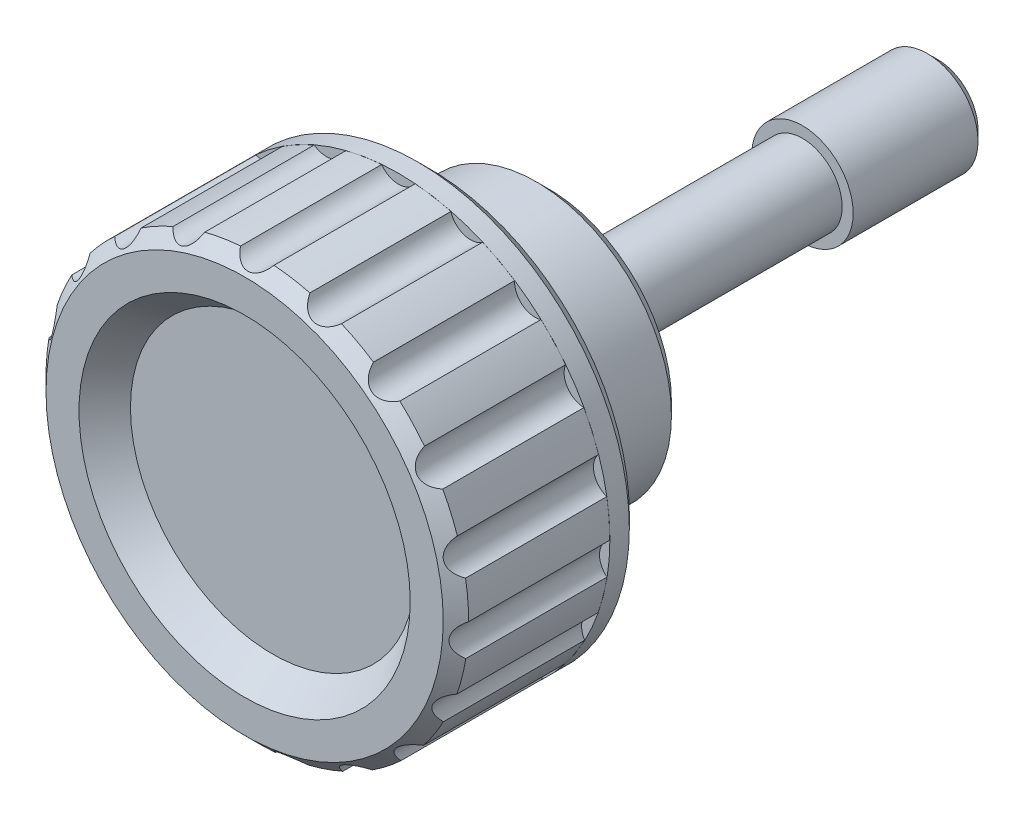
ISO-10303-21;
HEADER;
FILE_DESCRIPTION(('STEP AP214'),'2;1');
FILE_NAME('part.step','',(''),(''),'','','');
FILE_SCHEMA(('AUTOMOTIVE_DESIGN { 1 0 10303 214 1 1 1 1 }'));
ENDSEC;
DATA;
#1=APPLICATION_CONTEXT('core data for automotive mechanical design processes');
#2=APPLICATION_PROTOCOL_DEFINITION('international standard','automotive_design',2000,#1);
#3=PRODUCT_CONTEXT('',#1,'mechanical');
#4=PRODUCT('Part','Part','',(#3));
#5=PRODUCT_RELATED_PRODUCT_CATEGORY('part','',(#4));
#6=PRODUCT_DEFINITION_FORMATION('','',#4);
#7=PRODUCT_DEFINITION_CONTEXT('part definition',#1,'design');
#8=PRODUCT_DEFINITION('design','',#6,#7);
#9=PRODUCT_DEFINITION_SHAPE('','',#8);
#10=(LENGTH_UNIT() NAMED_UNIT(*) SI_UNIT(.MILLI.,.METRE.));
#11=(NAMED_UNIT(*) PLANE_ANGLE_UNIT() SI_UNIT($,.RADIAN.));
#12=(NAMED_UNIT(*) SI_UNIT($,.STERADIAN.) SOLID_ANGLE_UNIT());
#13=UNCERTAINTY_MEASURE_WITH_UNIT(LENGTH_MEASURE(1.E-05),#10,'distance_accuracy_value','');
#14=(GEOMETRIC_REPRESENTATION_CONTEXT(3) GLOBAL_UNCERTAINTY_ASSIGNED_CONTEXT((#13)) GLOBAL_UNIT_ASSIGNED_CONTEXT((#10,
#11,#12)) REPRESENTATION_CONTEXT('',''));
#15=CARTESIAN_POINT('',(0.,0.,0.));
#16=DIRECTION('',(0.,0.,1.));
#17=DIRECTION('',(1.,0.,0.));
#18=AXIS2_PLACEMENT_3D('',#15,#16,#17);
#19=CARTESIAN_POINT('',(0.,0.,0.));
#20=DIRECTION('',(0.,0.,1.));
#21=DIRECTION('',(1.,0.,0.));
#22=AXIS2_PLACEMENT_3D('',#19,#20,#21);
#23=PLANE('',#22);
#24=CARTESIAN_POINT('',(0.,0.,0.));
#25=DIRECTION('',(0.,0.,1.));
#26=DIRECTION('',(1.,0.,0.));
#27=AXIS2_PLACEMENT_3D('',#24,#25,#26);
#28=CIRCLE('',#27,4.);
#29=CARTESIAN_POINT('',(4.,0.,0.));
#30=VERTEX_POINT('',#29);
#31=EDGE_CURVE('E404',#30,#30,#28,.T.);
#32=ORIENTED_EDGE('',*,*,#31,.F.);
#33=EDGE_LOOP('',(#32));
#34=FACE_BOUND('',#33,.T.);
#35=CARTESIAN_POINT('',(0.,0.,0.));
#36=DIRECTION('',(0.,0.,1.));
#37=DIRECTION('',(1.,0.,0.));
#38=AXIS2_PLACEMENT_3D('',#35,#36,#37);
#39=CIRCLE('',#38,2.35);
#40=CARTESIAN_POINT('',(2.35,0.,0.));
#41=VERTEX_POINT('',#40);
#42=EDGE_CURVE('E459',#41,#41,#39,.T.);
#43=ORIENTED_EDGE('',*,*,#42,.T.);
#44=EDGE_LOOP('',(#43));
#45=FACE_BOUND('',#44,.T.);
#46=ADVANCED_FACE('F14',(#34,#45),#23,.F.);
#47=CARTESIAN_POINT('',(0.,0.,19.75));
#48=DIRECTION('',(0.,0.,1.));
#49=DIRECTION('',(1.,0.,0.));
#50=AXIS2_PLACEMENT_3D('',#47,#48,#49);
#51=CYLINDRICAL_SURFACE('',#50,4.);
#52=CARTESIAN_POINT('',(0.,0.,1.));
#53=DIRECTION('',(0.,0.,1.));
#54=DIRECTION('',(1.,0.,0.));
#55=AXIS2_PLACEMENT_3D('',#52,#53,#54);
#56=CIRCLE('',#55,4.);
#57=CARTESIAN_POINT('',(4.,0.,1.00000000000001));
#58=VERTEX_POINT('',#57);
#59=EDGE_CURVE('E401',#58,#58,#56,.T.);
#60=ORIENTED_EDGE('',*,*,#59,.F.);
#61=EDGE_LOOP('',(#60));
#62=FACE_BOUND('',#61,.T.);
#63=ORIENTED_EDGE('',*,*,#31,.T.);
#64=EDGE_LOOP('',(#63));
#65=FACE_BOUND('',#64,.T.);
#66=ADVANCED_FACE('F448',(#62,#65),#51,.T.);
#67=CARTESIAN_POINT('',(0.,4.,1.));
#68=DIRECTION('',(0.,0.,1.));
#69=DIRECTION('',(1.,0.,0.));
#70=AXIS2_PLACEMENT_3D('',#67,#68,#69);
#71=PLANE('',#70);
#72=CARTESIAN_POINT('',(0.,0.,1.));
#73=DIRECTION('',(0.,0.,1.));
#74=DIRECTION('',(1.,0.,0.));
#75=AXIS2_PLACEMENT_3D('',#72,#73,#74);
#76=CIRCLE('',#75,7.25);
#77=CARTESIAN_POINT('',(7.25,0.,1.00000000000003));
#78=VERTEX_POINT('',#77);
#79=EDGE_CURVE('E398',#78,#78,#76,.T.);
#80=ORIENTED_EDGE('',*,*,#79,.F.);
#81=EDGE_LOOP('',(#80));
#82=FACE_BOUND('',#81,.T.);
#83=ORIENTED_EDGE('',*,*,#59,.T.);
#84=EDGE_LOOP('',(#83));
#85=FACE_BOUND('',#84,.T.);
#86=ADVANCED_FACE('F453',(#82,#85),#71,.F.);
#87=CARTESIAN_POINT('',(0.,0.,1.));
#88=DIRECTION('',(0.,0.,1.));
#89=DIRECTION('',(1.,0.,0.));
#90=AXIS2_PLACEMENT_3D('',#87,#88,#89);
#91=CONICAL_SURFACE('',#90,7.25,0.785398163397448);
#92=CARTESIAN_POINT('',(0.,0.,1.75));
#93=DIRECTION('',(0.,0.,1.));
#94=DIRECTION('',(1.,0.,0.));
#95=AXIS2_PLACEMENT_3D('',#92,#93,#94);
#96=CIRCLE('',#95,8.);
#97=CARTESIAN_POINT('',(7.99999999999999,0.,1.75000000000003));
#98=VERTEX_POINT('',#97);
#99=EDGE_CURVE('E395',#98,#98,#96,.T.);
#100=ORIENTED_EDGE('',*,*,#99,.F.);
#101=EDGE_LOOP('',(#100));
#102=FACE_BOUND('',#101,.T.);
#103=ORIENTED_EDGE('',*,*,#79,.T.);
#104=EDGE_LOOP('',(#103));
#105=FACE_BOUND('',#104,.T.);
#106=ADVANCED_FACE('F1256',(#102,#105),#91,.T.);
#107=CARTESIAN_POINT('',(0.,0.,19.75));
#108=DIRECTION('',(0.,0.,1.));
#109=DIRECTION('',(1.,0.,0.));
#110=AXIS2_PLACEMENT_3D('',#107,#108,#109);
#111=CYLINDRICAL_SURFACE('',#110,8.);
#112=CARTESIAN_POINT('',(0.,0.,8.));
#113=DIRECTION('',(0.,0.,1.));
#114=DIRECTION('',(1.,0.,0.));
#115=AXIS2_PLACEMENT_3D('',#112,#113,#114);
#116=CIRCLE('',#115,8.);
#117=CARTESIAN_POINT('',(7.99999999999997,0.,8.00000000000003));
#118=VERTEX_POINT('',#117);
#119=EDGE_CURVE('E392',#118,#118,#116,.T.);
#120=ORIENTED_EDGE('',*,*,#119,.F.);
#121=EDGE_LOOP('',(#120));
#122=FACE_BOUND('',#121,.T.);
#123=ORIENTED_EDGE('',*,*,#99,.T.);
#124=EDGE_LOOP('',(#123));
#125=FACE_BOUND('',#124,.T.);
#126=ADVANCED_FACE('F1246',(#122,#125),#111,.T.);
#127=CARTESIAN_POINT('',(0.,8.,8.));
#128=DIRECTION('',(0.,0.,1.));
#129=DIRECTION('',(1.,0.,0.));
#130=AXIS2_PLACEMENT_3D('',#127,#128,#129);
#131=PLANE('',#130);
#132=CARTESIAN_POINT('',(0.,0.,8.));
#133=DIRECTION('',(0.,0.,1.));
#134=DIRECTION('',(1.,0.,0.));
#135=AXIS2_PLACEMENT_3D('',#132,#133,#134);
#136=CIRCLE('',#135,8.42105263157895);
#137=CARTESIAN_POINT('',(8.42105263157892,0.,8.00000000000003));
#138=VERTEX_POINT('',#137);
#139=EDGE_CURVE('E389',#138,#138,#136,.T.);
#140=ORIENTED_EDGE('',*,*,#139,.F.);
#141=EDGE_LOOP('',(#140));
#142=FACE_BOUND('',#141,.T.);
#143=ORIENTED_EDGE('',*,*,#119,.T.);
#144=EDGE_LOOP('',(#143));
#145=FACE_BOUND('',#144,.T.);
#146=ADVANCED_FACE('F1236',(#142,#145),#131,.F.);
#147=CARTESIAN_POINT('',(0.,0.,19.75));
#148=DIRECTION('',(0.,0.,1.));
#149=DIRECTION('',(1.,0.,0.));
#150=AXIS2_PLACEMENT_3D('',#147,#148,#149);
#151=CYLINDRICAL_SURFACE('',#150,8.42105263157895);
#152=CARTESIAN_POINT('',(0.,0.,13.5));
#153=DIRECTION('',(0.,0.,1.));
#154=DIRECTION('',(1.,0.,0.));
#155=AXIS2_PLACEMENT_3D('',#152,#153,#154);
#156=CIRCLE('',#155,8.42105263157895);
#157=CARTESIAN_POINT('',(8.4210526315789,0.,13.5));
#158=VERTEX_POINT('',#157);
#159=EDGE_CURVE('E386',#158,#158,#156,.T.);
#160=ORIENTED_EDGE('',*,*,#159,.F.);
#161=EDGE_LOOP('',(#160));
#162=FACE_BOUND('',#161,.T.);
#163=ORIENTED_EDGE('',*,*,#139,.T.);
#164=EDGE_LOOP('',(#163));
#165=FACE_BOUND('',#164,.T.);
#166=ADVANCED_FACE('F1226',(#162,#165),#151,.T.);
#167=CARTESIAN_POINT('',(0.,8.42105263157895,13.5));
#168=DIRECTION('',(0.,0.,1.));
#169=DIRECTION('',(1.,0.,0.));
#170=AXIS2_PLACEMENT_3D('',#167,#168,#169);
#171=PLANE('',#170);
#172=CARTESIAN_POINT('',(0.,0.,13.5));
#173=DIRECTION('',(0.,0.,1.));
#174=DIRECTION('',(1.,0.,0.));
#175=AXIS2_PLACEMENT_3D('',#172,#173,#174);
#176=CIRCLE('',#175,10.8695652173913);
#177=CARTESIAN_POINT('',(10.8695652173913,0.,13.5));
#178=VERTEX_POINT('',#177);
#179=EDGE_CURVE('E383',#178,#178,#176,.T.);
#180=ORIENTED_EDGE('',*,*,#179,.F.);
#181=EDGE_LOOP('',(#180));
#182=FACE_BOUND('',#181,.T.);
#183=ORIENTED_EDGE('',*,*,#159,.T.);
#184=EDGE_LOOP('',(#183));
#185=FACE_BOUND('',#184,.T.);
#186=ADVANCED_FACE('F1217',(#182,#185),#171,.F.);
#187=CARTESIAN_POINT('',(0.,0.,19.75));
#188=DIRECTION('',(0.,0.,1.));
#189=DIRECTION('',(1.,0.,0.));
#190=AXIS2_PLACEMENT_3D('',#187,#188,#189);
#191=CYLINDRICAL_SURFACE('',#190,10.8695652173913);
#192=CARTESIAN_POINT('',(0.,0.,8.));
#193=DIRECTION('',(0.,0.,1.));
#194=DIRECTION('',(1.,0.,0.));
#195=AXIS2_PLACEMENT_3D('',#192,#193,#194);
#196=CIRCLE('',#195,10.8695652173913);
#197=CARTESIAN_POINT('',(10.8695652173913,0.,8.00000000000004));
#198=VERTEX_POINT('',#197);
#199=EDGE_CURVE('E279',#198,#198,#196,.T.);
#200=ORIENTED_EDGE('',*,*,#199,.F.);
#201=EDGE_LOOP('',(#200));
#202=FACE_BOUND('',#201,.T.);
#203=ORIENTED_EDGE('',*,*,#179,.T.);
#204=EDGE_LOOP('',(#203));
#205=FACE_BOUND('',#204,.T.);
#206=ADVANCED_FACE('F894',(#202,#205),#191,.F.);
#207=CARTESIAN_POINT('',(0.,10.8695652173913,9.9));
#208=DIRECTION('',(0.,0.,1.));
#209=DIRECTION('',(1.,0.,0.));
#210=AXIS2_PLACEMENT_3D('',#207,#208,#209);
#211=PLANE('',#210);
#212=CARTESIAN_POINT('',(0.,0.,9.9));
#213=DIRECTION('',(0.,0.,1.));
#214=DIRECTION('',(1.,0.,0.));
#215=AXIS2_PLACEMENT_3D('',#212,#213,#214);
#216=CIRCLE('',#215,12.51);
#217=CARTESIAN_POINT('',(12.51,0.,9.90000000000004));
#218=VERTEX_POINT('',#217);
#219=EDGE_CURVE('E481',#218,#218,#216,.T.);
#220=ORIENTED_EDGE('',*,*,#219,.T.);
#221=EDGE_LOOP('',(#220));
#222=FACE_BOUND('',#221,.T.);
#223=CARTESIAN_POINT('',(-12.7379194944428,3.2256793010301,9.9));
#224=DIRECTION('',(0.,0.,1.));
#225=DIRECTION('',(1.,0.,0.));
#226=AXIS2_PLACEMENT_3D('',#223,#224,#225);
#227=CIRCLE('',#226,1.2);
#228=CARTESIAN_POINT('',(-12.3223485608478,2.09993474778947,9.9));
#229=VERTEX_POINT('',#228);
#230=CARTESIAN_POINT('',(-11.836640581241,4.01795218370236,9.9));
#231=VERTEX_POINT('',#230);
#232=EDGE_CURVE('E273',#229,#231,#227,.T.);
#233=ORIENTED_EDGE('',*,*,#232,.T.);
#234=CARTESIAN_POINT('',(-2.68753334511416E-13,0.,9.9));
#235=DIRECTION('',(0.,0.,1.));
#236=DIRECTION('',(1.,0.,0.));
#237=AXIS2_PLACEMENT_3D('',#234,#235,#236);
#238=CIRCLE('',#237,12.4999999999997);
#239=CARTESIAN_POINT('',(-10.9728420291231,5.98721452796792,9.9));
#240=VERTEX_POINT('',#239);
#241=EDGE_CURVE('E372',#240,#231,#238,.T.);
#242=ORIENTED_EDGE('',*,*,#241,.F.);
#243=CARTESIAN_POINT('',(-11.0003675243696,7.18689879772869,9.9));
#244=DIRECTION('',(0.,0.,1.));
#245=DIRECTION('',(1.,0.,0.));
#246=AXIS2_PLACEMENT_3D('',#243,#244,#245);
#247=CIRCLE('',#246,1.2);
#248=CARTESIAN_POINT('',(-9.89067180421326,7.64359936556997,9.9));
#249=VERTEX_POINT('',#248);
#250=EDGE_CURVE('E369',#240,#249,#247,.T.);
#251=ORIENTED_EDGE('',*,*,#250,.T.);
#252=CARTESIAN_POINT('',(-3.5895895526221E-13,2.77555756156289E-13,9.9));
#253=DIRECTION('',(0.,0.,1.));
#254=DIRECTION('',(1.,0.,0.));
#255=AXIS2_PLACEMENT_3D('',#252,#253,#254);
#256=CIRCLE('',#255,12.4999999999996);
#257=CARTESIAN_POINT('',(-8.43425780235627,9.22568671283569,9.9));
#258=VERTEX_POINT('',#257);
#259=EDGE_CURVE('E367',#258,#249,#256,.T.);
#260=ORIENTED_EDGE('',*,*,#259,.F.);
#261=CARTESIAN_POINT('',(-8.07075504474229,10.3693062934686,9.9));
#262=DIRECTION('',(0.,0.,1.));
#263=DIRECTION('',(1.,0.,0.));
#264=AXIS2_PLACEMENT_3D('',#261,#262,#263);
#265=CIRCLE('',#264,1.2);
#266=CARTESIAN_POINT('',(-6.87289526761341,10.4409439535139,9.9));
#267=VERTEX_POINT('',#266);
#268=EDGE_CURVE('E364',#258,#267,#265,.T.);
#269=ORIENTED_EDGE('',*,*,#268,.T.);
#270=CARTESIAN_POINT('',(1.89213663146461E-13,-4.28476698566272E-13,9.9));
#271=DIRECTION('',(0.,0.,1.));
#272=DIRECTION('',(1.,0.,0.));
#273=AXIS2_PLACEMENT_3D('',#270,#271,#272);
#274=CIRCLE('',#273,12.5000000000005);
#275=CARTESIAN_POINT('',(-4.98169087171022,11.464412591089,9.9));
#276=VERTEX_POINT('',#275);
#277=EDGE_CURVE('E362',#276,#267,#274,.T.);
#278=ORIENTED_EDGE('',*,*,#277,.F.);
#279=CARTESIAN_POINT('',(-4.26655102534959,12.4280385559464,9.9));
#280=DIRECTION('',(0.,0.,1.));
#281=DIRECTION('',(1.,0.,0.));
#282=AXIS2_PLACEMENT_3D('',#279,#280,#281);
#283=CIRCLE('',#282,1.2);
#284=CARTESIAN_POINT('',(-3.11033388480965,12.1068502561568,9.9));
#285=VERTEX_POINT('',#284);
#286=EDGE_CURVE('E359',#276,#285,#283,.T.);
#287=ORIENTED_EDGE('',*,*,#286,.T.);
#288=CARTESIAN_POINT('',(0.,-6.66133814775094E-13,9.9));
#289=DIRECTION('',(0.,0.,1.));
#290=DIRECTION('',(1.,0.,0.));
#291=AXIS2_PLACEMENT_3D('',#288,#289,#290);
#292=CIRCLE('',#291,12.5000000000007);
#293=CARTESIAN_POINT('',(-0.989280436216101,12.4607914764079,9.9));
#294=VERTEX_POINT('',#293);
#295=EDGE_CURVE('E357',#294,#285,#292,.T.);
#296=ORIENTED_EDGE('',*,*,#295,.F.);
#297=CARTESIAN_POINT('',(0.,13.14,9.9));
#298=DIRECTION('',(0.,0.,1.));
#299=DIRECTION('',(1.,0.,0.));
#300=AXIS2_PLACEMENT_3D('',#297,#298,#299);
#301=CIRCLE('',#300,1.2);
#302=CARTESIAN_POINT('',(0.989280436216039,12.4607914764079,9.9));
#303=VERTEX_POINT('',#302);
#304=EDGE_CURVE('E355',#294,#303,#301,.T.);
#305=ORIENTED_EDGE('',*,*,#304,.T.);
#306=CARTESIAN_POINT('',(0.,0.,9.9));
#307=DIRECTION('',(0.,0.,1.));
#308=DIRECTION('',(1.,0.,0.));
#309=AXIS2_PLACEMENT_3D('',#306,#307,#308);
#310=CIRCLE('',#309,12.5);
#311=CARTESIAN_POINT('',(3.11033388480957,12.1068502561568,9.9));
#312=VERTEX_POINT('',#311);
#313=EDGE_CURVE('E352',#312,#303,#310,.T.);
#314=ORIENTED_EDGE('',*,*,#313,.F.);
#315=CARTESIAN_POINT('',(4.26655102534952,12.4280385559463,9.9));
#316=DIRECTION('',(0.,0.,1.));
#317=DIRECTION('',(1.,0.,0.));
#318=AXIS2_PLACEMENT_3D('',#315,#316,#317);
#319=CIRCLE('',#318,1.2);
#320=CARTESIAN_POINT('',(4.98169087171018,11.464412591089,9.9));
#321=VERTEX_POINT('',#320);
#322=EDGE_CURVE('E349',#312,#321,#319,.T.);
#323=ORIENTED_EDGE('',*,*,#322,.T.);
#324=CARTESIAN_POINT('',(-1.31710179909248E-13,-1.82145964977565E-13,9.9));
#325=DIRECTION('',(0.,0.,1.));
#326=DIRECTION('',(1.,0.,0.));
#327=AXIS2_PLACEMENT_3D('',#324,#325,#326);
#328=CIRCLE('',#327,12.5000000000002);
#329=CARTESIAN_POINT('',(6.87289526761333,10.4409439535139,9.9));
#330=VERTEX_POINT('',#329);
#331=EDGE_CURVE('E347',#330,#321,#328,.T.);
#332=ORIENTED_EDGE('',*,*,#331,.F.);
#333=CARTESIAN_POINT('',(8.07075504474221,10.3693062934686,9.9));
#334=DIRECTION('',(0.,0.,1.));
#335=DIRECTION('',(1.,0.,0.));
#336=AXIS2_PLACEMENT_3D('',#333,#334,#335);
#337=CIRCLE('',#336,1.2);
#338=CARTESIAN_POINT('',(8.43425780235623,9.22568671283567,9.9));
#339=VERTEX_POINT('',#338);
#340=EDGE_CURVE('E344',#330,#339,#337,.T.);
#341=ORIENTED_EDGE('',*,*,#340,.T.);
#342=CARTESIAN_POINT('',(1.18090000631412E-13,1.35308431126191E-13,9.9));
#343=DIRECTION('',(0.,0.,1.));
#344=DIRECTION('',(1.,0.,0.));
#345=AXIS2_PLACEMENT_3D('',#342,#343,#344);
#346=CIRCLE('',#345,12.4999999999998);
#347=CARTESIAN_POINT('',(9.89067180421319,7.64359936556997,9.9));
#348=VERTEX_POINT('',#347);
#349=EDGE_CURVE('E342',#348,#339,#346,.T.);
#350=ORIENTED_EDGE('',*,*,#349,.F.);
#351=CARTESIAN_POINT('',(11.0003675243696,7.18689879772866,9.9));
#352=DIRECTION('',(0.,0.,1.));
#353=DIRECTION('',(1.,0.,0.));
#354=AXIS2_PLACEMENT_3D('',#351,#352,#353);
#355=CIRCLE('',#354,1.2);
#356=CARTESIAN_POINT('',(10.9728420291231,5.98721452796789,9.9));
#357=VERTEX_POINT('',#356);
#358=EDGE_CURVE('E339',#348,#357,#355,.T.);
#359=ORIENTED_EDGE('',*,*,#358,.T.);
#360=CARTESIAN_POINT('',(-2.70488057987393E-13,0.,9.9));
#361=DIRECTION('',(0.,0.,1.));
#362=DIRECTION('',(1.,0.,0.));
#363=AXIS2_PLACEMENT_3D('',#360,#361,#362);
#364=CIRCLE('',#363,12.5000000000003);
#365=CARTESIAN_POINT('',(11.836640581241,4.01795218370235,9.9));
#366=VERTEX_POINT('',#365);
#367=EDGE_CURVE('E337',#366,#357,#364,.T.);
#368=ORIENTED_EDGE('',*,*,#367,.F.);
#369=CARTESIAN_POINT('',(12.7379194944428,3.2256793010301,9.9));
#370=DIRECTION('',(0.,0.,1.));
#371=DIRECTION('',(1.,0.,0.));
#372=AXIS2_PLACEMENT_3D('',#369,#370,#371);
#373=CIRCLE('',#372,1.2);
#374=CARTESIAN_POINT('',(12.3223485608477,2.09993474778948,9.9));
#375=VERTEX_POINT('',#374);
#376=EDGE_CURVE('E334',#366,#375,#373,.T.);
#377=ORIENTED_EDGE('',*,*,#376,.T.);
#378=CARTESIAN_POINT('',(-2.44467205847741E-13,0.,9.9));
#379=DIRECTION('',(0.,0.,1.));
#380=DIRECTION('',(1.,0.,0.));
#381=AXIS2_PLACEMENT_3D('',#378,#379,#380);
#382=CIRCLE('',#381,12.5000000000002);
#383=CARTESIAN_POINT('',(12.4999256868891,-0.0431024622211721,9.9));
#384=VERTEX_POINT('',#383);
#385=EDGE_CURVE('E332',#384,#375,#382,.T.);
#386=ORIENTED_EDGE('',*,*,#385,.F.);
#387=CARTESIAN_POINT('',(13.0951202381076,-1.08509259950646,9.9));
#388=DIRECTION('',(0.,0.,1.));
#389=DIRECTION('',(1.,0.,0.));
#390=AXIS2_PLACEMENT_3D('',#387,#388,#389);
#391=CIRCLE('',#390,1.2);
#392=CARTESIAN_POINT('',(12.3365374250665,-2.01490554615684,9.9));
#393=VERTEX_POINT('',#392);
#394=EDGE_CURVE('E329',#384,#393,#391,.T.);
#395=ORIENTED_EDGE('',*,*,#394,.T.);
#396=CARTESIAN_POINT('',(-1.76812990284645E-13,0.,9.9));
#397=DIRECTION('',(0.,0.,1.));
#398=DIRECTION('',(1.,0.,0.));
#399=AXIS2_PLACEMENT_3D('',#396,#397,#398);
#400=CIRCLE('',#399,12.5000000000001);
#401=CARTESIAN_POINT('',(11.8086498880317,-4.09948628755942,9.9));
#402=VERTEX_POINT('',#401);
#403=EDGE_CURVE('E327',#402,#393,#400,.T.);
#404=ORIENTED_EDGE('',*,*,#403,.F.);
#405=CARTESIAN_POINT('',(12.0332615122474,-5.27827787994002,9.9));
#406=DIRECTION('',(0.,0.,1.));
#407=DIRECTION('',(1.,0.,0.));
#408=AXIS2_PLACEMENT_3D('',#405,#406,#407);
#409=CIRCLE('',#408,1.2);
#410=CARTESIAN_POINT('',(11.0138710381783,-5.91139955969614,9.9));
#411=VERTEX_POINT('',#410);
#412=EDGE_CURVE('E324',#402,#411,#409,.T.);
#413=ORIENTED_EDGE('',*,*,#412,.T.);
#414=CARTESIAN_POINT('',(1.61458087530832E-13,-1.36175792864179E-13,9.9));
#415=DIRECTION('',(0.,0.,1.));
#416=DIRECTION('',(1.,0.,0.));
#417=AXIS2_PLACEMENT_3D('',#414,#415,#416);
#418=CIRCLE('',#417,12.4999999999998);
#419=CARTESIAN_POINT('',(9.83772364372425,-7.71162716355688,9.9));
#420=VERTEX_POINT('',#419);
#421=EDGE_CURVE('E322',#420,#411,#418,.T.);
#422=ORIENTED_EDGE('',*,*,#421,.F.);
#423=CARTESIAN_POINT('',(9.66741218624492,-8.89947985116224,9.9));
#424=DIRECTION('',(0.,0.,1.));
#425=DIRECTION('',(1.,0.,0.));
#426=AXIS2_PLACEMENT_3D('',#423,#424,#425);
#427=CIRCLE('',#426,1.2);
#428=CARTESIAN_POINT('',(8.4976808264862,-9.16730170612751,9.9));
#429=VERTEX_POINT('',#428);
#430=EDGE_CURVE('E319',#420,#429,#427,.T.);
#431=ORIENTED_EDGE('',*,*,#430,.T.);
#432=CARTESIAN_POINT('',(0.,-1.78676518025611E-13,9.9));
#433=DIRECTION('',(0.,0.,1.));
#434=DIRECTION('',(1.,0.,0.));
#435=AXIS2_PLACEMENT_3D('',#432,#433,#434);
#436=CIRCLE('',#435,12.4999999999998);
#437=CARTESIAN_POINT('',(6.80072739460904,-10.4880935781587,9.9));
#438=VERTEX_POINT('',#437);
#439=EDGE_CURVE('E317',#438,#429,#436,.T.);
#440=ORIENTED_EDGE('',*,*,#439,.F.);
#441=CARTESIAN_POINT('',(6.25394874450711,-11.5562850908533,9.9));
#442=DIRECTION('',(0.,0.,1.));
#443=DIRECTION('',(1.,0.,0.));
#444=AXIS2_PLACEMENT_3D('',#441,#442,#443);
#445=CIRCLE('',#444,1.2);
#446=CARTESIAN_POINT('',(5.06063504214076,-11.4297844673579,9.9));
#447=VERTEX_POINT('',#446);
#448=EDGE_CURVE('E314',#438,#447,#445,.T.);
#449=ORIENTED_EDGE('',*,*,#448,.T.);
#450=CARTESIAN_POINT('',(-1.56429989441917E-13,3.66026653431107E-13,9.9));
#451=DIRECTION('',(0.,0.,1.));
#452=DIRECTION('',(1.,0.,0.));
#453=AXIS2_PLACEMENT_3D('',#450,#451,#452);
#454=CIRCLE('',#453,12.5000000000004);
#455=CARTESIAN_POINT('',(3.02676680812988,-12.1280123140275,9.9));
#456=VERTEX_POINT('',#455);
#457=EDGE_CURVE('E312',#456,#447,#454,.T.);
#458=ORIENTED_EDGE('',*,*,#457,.F.);
#459=CARTESIAN_POINT('',(2.16277291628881,-12.9607875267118,9.9));
#460=DIRECTION('',(0.,0.,1.));
#461=DIRECTION('',(1.,0.,0.));
#462=AXIS2_PLACEMENT_3D('',#459,#460,#461);
#463=CIRCLE('',#462,1.2);
#464=CARTESIAN_POINT('',(1.07519092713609,-12.453672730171,9.9));
#465=VERTEX_POINT('',#464);
#466=EDGE_CURVE('E309',#456,#465,#463,.T.);
#467=ORIENTED_EDGE('',*,*,#466,.T.);
#468=CARTESIAN_POINT('',(0.,-4.82253126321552E-13,9.9));
#469=DIRECTION('',(0.,0.,1.));
#470=DIRECTION('',(1.,0.,0.));
#471=AXIS2_PLACEMENT_3D('',#468,#469,#470);
#472=CIRCLE('',#471,12.4999999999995);
#473=CARTESIAN_POINT('',(-1.07519092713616,-12.453672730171,9.9));
#474=VERTEX_POINT('',#473);
#475=EDGE_CURVE('E307',#474,#465,#472,.T.);
#476=ORIENTED_EDGE('',*,*,#475,.F.);
#477=CARTESIAN_POINT('',(-2.16277291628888,-12.9607875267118,9.9));
#478=DIRECTION('',(0.,0.,1.));
#479=DIRECTION('',(1.,0.,0.));
#480=AXIS2_PLACEMENT_3D('',#477,#478,#479);
#481=CIRCLE('',#480,1.2);
#482=CARTESIAN_POINT('',(-3.02676680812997,-12.1280123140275,9.9));
#483=VERTEX_POINT('',#482);
#484=EDGE_CURVE('E304',#474,#483,#481,.T.);
#485=ORIENTED_EDGE('',*,*,#484,.T.);
#486=CARTESIAN_POINT('',(-1.04821966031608E-13,-2.4980018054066E-13,9.9));
#487=DIRECTION('',(0.,0.,1.));
#488=DIRECTION('',(1.,0.,0.));
#489=AXIS2_PLACEMENT_3D('',#486,#487,#488);
#490=CIRCLE('',#489,12.4999999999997);
#491=CARTESIAN_POINT('',(-5.06063504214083,-11.4297844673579,9.9));
#492=VERTEX_POINT('',#491);
#493=EDGE_CURVE('E302',#492,#483,#490,.T.);
#494=ORIENTED_EDGE('',*,*,#493,.F.);
#495=CARTESIAN_POINT('',(-6.25394874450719,-11.5562850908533,9.9));
#496=DIRECTION('',(0.,0.,1.));
#497=DIRECTION('',(1.,0.,0.));
#498=AXIS2_PLACEMENT_3D('',#495,#496,#497);
#499=CIRCLE('',#498,1.2);
#500=CARTESIAN_POINT('',(-6.80072739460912,-10.4880935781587,9.9));
#501=VERTEX_POINT('',#500);
#502=EDGE_CURVE('E299',#492,#501,#499,.T.);
#503=ORIENTED_EDGE('',*,*,#502,.T.);
#504=CARTESIAN_POINT('',(-1.66404649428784E-13,-1.40512601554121E-13,9.9));
#505=DIRECTION('',(0.,0.,1.));
#506=DIRECTION('',(1.,0.,0.));
#507=AXIS2_PLACEMENT_3D('',#504,#505,#506);
#508=CIRCLE('',#507,12.4999999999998);
#509=CARTESIAN_POINT('',(-8.49768082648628,-9.1673017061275,9.9));
#510=VERTEX_POINT('',#509);
#511=EDGE_CURVE('E297',#510,#501,#508,.T.);
#512=ORIENTED_EDGE('',*,*,#511,.F.);
#513=CARTESIAN_POINT('',(-9.66741218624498,-8.89947985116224,9.9));
#514=DIRECTION('',(0.,0.,1.));
#515=DIRECTION('',(1.,0.,0.));
#516=AXIS2_PLACEMENT_3D('',#513,#514,#515);
#517=CIRCLE('',#516,1.2);
#518=CARTESIAN_POINT('',(-9.83772364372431,-7.71162716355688,9.9));
#519=VERTEX_POINT('',#518);
#520=EDGE_CURVE('E294',#510,#519,#517,.T.);
#521=ORIENTED_EDGE('',*,*,#520,.T.);
#522=CARTESIAN_POINT('',(2.86358177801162E-13,2.12503625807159E-13,9.9));
#523=DIRECTION('',(0.,0.,1.));
#524=DIRECTION('',(1.,0.,0.));
#525=AXIS2_PLACEMENT_3D('',#522,#523,#524);
#526=CIRCLE('',#525,12.5000000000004);
#527=CARTESIAN_POINT('',(-11.0138710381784,-5.91139955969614,9.9));
#528=VERTEX_POINT('',#527);
#529=EDGE_CURVE('E292',#528,#519,#526,.T.);
#530=ORIENTED_EDGE('',*,*,#529,.F.);
#531=CARTESIAN_POINT('',(-12.0332615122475,-5.27827787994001,9.9));
#532=DIRECTION('',(0.,0.,1.));
#533=DIRECTION('',(1.,0.,0.));
#534=AXIS2_PLACEMENT_3D('',#531,#532,#533);
#535=CIRCLE('',#534,1.2);
#536=CARTESIAN_POINT('',(-11.8086498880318,-4.09948628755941,9.9));
#537=VERTEX_POINT('',#536);
#538=EDGE_CURVE('E286',#528,#537,#535,.T.);
#539=ORIENTED_EDGE('',*,*,#538,.T.);
#540=CARTESIAN_POINT('',(-4.49164576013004E-13,0.,9.9));
#541=DIRECTION('',(0.,0.,1.));
#542=DIRECTION('',(1.,0.,0.));
#543=AXIS2_PLACEMENT_3D('',#540,#541,#542);
#544=CIRCLE('',#543,12.4999999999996);
#545=CARTESIAN_POINT('',(-12.3365374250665,-2.01490554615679,9.9));
#546=VERTEX_POINT('',#545);
#547=EDGE_CURVE('E284',#546,#537,#544,.T.);
#548=ORIENTED_EDGE('',*,*,#547,.F.);
#549=CARTESIAN_POINT('',(-13.0951202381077,-1.08509259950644,9.9));
#550=DIRECTION('',(0.,0.,1.));
#551=DIRECTION('',(1.,0.,0.));
#552=AXIS2_PLACEMENT_3D('',#549,#550,#551);
#553=CIRCLE('',#552,1.2);
#554=CARTESIAN_POINT('',(-12.4999256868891,-0.0431024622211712,9.9));
#555=VERTEX_POINT('',#554);
#556=EDGE_CURVE('E276',#546,#555,#553,.T.);
#557=ORIENTED_EDGE('',*,*,#556,.T.);
#558=CARTESIAN_POINT('',(0.,0.,9.9));
#559=DIRECTION('',(0.,0.,1.));
#560=DIRECTION('',(1.,0.,0.));
#561=AXIS2_PLACEMENT_3D('',#558,#559,#560);
#562=CIRCLE('',#561,12.5);
#563=EDGE_CURVE('E264',#229,#555,#562,.T.);
#564=ORIENTED_EDGE('',*,*,#563,.F.);
#565=EDGE_LOOP('',(#233,#242,#251,#260,#269,#278,#287,#296,#305,#314,#323,#332,#341,#350,#359,
#368,#377,#386,#395,#404,#413,#422,#431,#440,#449,#458,#467,#476,#485,#494,#503,#512,#521,#530,
#539,#548,#557,#564));
#566=FACE_BOUND('',#565,.T.);
#567=ADVANCED_FACE('F282',(#222,#566),#211,.T.);
#568=CARTESIAN_POINT('',(0.,11.76,8.));
#569=DIRECTION('',(0.,0.,-1.));
#570=DIRECTION('',(-1.,0.,0.));
#571=AXIS2_PLACEMENT_3D('',#568,#569,#570);
#572=PLANE('',#571);
#573=ORIENTED_EDGE('',*,*,#199,.T.);
#574=EDGE_LOOP('',(#573));
#575=FACE_BOUND('',#574,.T.);
#576=CARTESIAN_POINT('',(0.,0.,8.));
#577=DIRECTION('',(0.,0.,1.));
#578=DIRECTION('',(1.,0.,0.));
#579=AXIS2_PLACEMENT_3D('',#576,#577,#578);
#580=CIRCLE('',#579,11.76);
#581=CARTESIAN_POINT('',(11.76,0.,8.00000000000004));
#582=VERTEX_POINT('',#581);
#583=EDGE_CURVE('E475',#582,#582,#580,.T.);
#584=ORIENTED_EDGE('',*,*,#583,.F.);
#585=EDGE_LOOP('',(#584));
#586=FACE_BOUND('',#585,.T.);
#587=ADVANCED_FACE('F887',(#575,#586),#572,.T.);
#588=CARTESIAN_POINT('',(0.,0.,19.));
#589=DIRECTION('',(0.,0.,1.));
#590=DIRECTION('',(1.,0.,0.));
#591=AXIS2_PLACEMENT_3D('',#588,#589,#590);
#592=CYLINDRICAL_SURFACE('',#591,12.51);
#593=CARTESIAN_POINT('',(0.,0.,8.75));
#594=DIRECTION('',(0.,0.,1.));
#595=DIRECTION('',(1.,0.,0.));
#596=AXIS2_PLACEMENT_3D('',#593,#594,#595);
#597=CIRCLE('',#596,12.51);
#598=CARTESIAN_POINT('',(12.51,0.,8.75000000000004));
#599=VERTEX_POINT('',#598);
#600=EDGE_CURVE('E478',#599,#599,#597,.T.);
#601=ORIENTED_EDGE('',*,*,#600,.T.);
#602=EDGE_LOOP('',(#601));
#603=FACE_BOUND('',#602,.T.);
#604=ORIENTED_EDGE('',*,*,#219,.F.);
#605=EDGE_LOOP('',(#604));
#606=FACE_BOUND('',#605,.T.);
#607=ADVANCED_FACE('F890',(#603,#606),#592,.T.);
#608=CARTESIAN_POINT('',(0.,0.,8.75));
#609=DIRECTION('',(0.,0.,1.));
#610=DIRECTION('',(1.,0.,0.));
#611=AXIS2_PLACEMENT_3D('',#608,#609,#610);
#612=CONICAL_SURFACE('',#611,12.51,0.785398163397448);
#613=ORIENTED_EDGE('',*,*,#583,.T.);
#614=EDGE_LOOP('',(#613));
#615=FACE_BOUND('',#614,.T.);
#616=ORIENTED_EDGE('',*,*,#600,.F.);
#617=EDGE_LOOP('',(#616));
#618=FACE_BOUND('',#617,.T.);
#619=ADVANCED_FACE('F433',(#615,#618),#612,.T.);
#620=CARTESIAN_POINT('',(0.,8.42105263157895,17.3333333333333));
#621=DIRECTION('',(0.,0.,-1.));
#622=DIRECTION('',(-1.,0.,0.));
#623=AXIS2_PLACEMENT_3D('',#620,#621,#622);
#624=PLANE('',#623);
#625=CARTESIAN_POINT('',(0.,0.,17.3333333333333));
#626=DIRECTION('',(0.,0.,1.));
#627=DIRECTION('',(1.,0.,0.));
#628=AXIS2_PLACEMENT_3D('',#625,#626,#627);
#629=CIRCLE('',#628,8.42105263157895);
#630=CARTESIAN_POINT('',(8.42105263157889,0.,17.3333333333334));
#631=VERTEX_POINT('',#630);
#632=EDGE_CURVE('E272',#631,#631,#629,.T.);
#633=ORIENTED_EDGE('',*,*,#632,.T.);
#634=EDGE_LOOP('',(#633));
#635=FACE_BOUND('',#634,.T.);
#636=ADVANCED_FACE('F429',(#635),#624,.F.);
#637=CARTESIAN_POINT('',(0.,0.,19.));
#638=DIRECTION('',(0.,0.,1.));
#639=DIRECTION('',(1.,0.,0.));
#640=AXIS2_PLACEMENT_3D('',#637,#638,#639);
#641=CONICAL_SURFACE('',#640,9.796875,0.690093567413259);
#642=ORIENTED_EDGE('',*,*,#632,.F.);
#643=EDGE_LOOP('',(#642));
#644=FACE_BOUND('',#643,.T.);
#645=CARTESIAN_POINT('',(0.,0.,19.));
#646=DIRECTION('',(0.,0.,1.));
#647=DIRECTION('',(1.,0.,0.));
#648=AXIS2_PLACEMENT_3D('',#645,#646,#647);
#649=CIRCLE('',#648,9.796875);
#650=CARTESIAN_POINT('',(9.79687499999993,0.,19.));
#651=VERTEX_POINT('',#650);
#652=EDGE_CURVE('E377',#651,#651,#649,.T.);
#653=ORIENTED_EDGE('',*,*,#652,.T.);
#654=EDGE_LOOP('',(#653));
#655=FACE_BOUND('',#654,.T.);
#656=ADVANCED_FACE('F432',(#644,#655),#641,.F.);
#657=CARTESIAN_POINT('',(0.,11.75,19.));
#658=DIRECTION('',(0.,0.,-1.));
#659=DIRECTION('',(-1.,0.,0.));
#660=AXIS2_PLACEMENT_3D('',#657,#658,#659);
#661=PLANE('',#660);
#662=ORIENTED_EDGE('',*,*,#652,.F.);
#663=EDGE_LOOP('',(#662));
#664=FACE_BOUND('',#663,.T.);
#665=CARTESIAN_POINT('',(0.,0.,19.));
#666=DIRECTION('',(0.,0.,1.));
#667=DIRECTION('',(1.,0.,0.));
#668=AXIS2_PLACEMENT_3D('',#665,#666,#667);
#669=CIRCLE('',#668,11.75);
#670=CARTESIAN_POINT('',(11.7499999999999,0.,19.));
#671=VERTEX_POINT('',#670);
#672=EDGE_CURVE('E380',#671,#671,#669,.T.);
#673=ORIENTED_EDGE('',*,*,#672,.T.);
#674=EDGE_LOOP('',(#673));
#675=FACE_BOUND('',#674,.T.);
#676=ADVANCED_FACE('F436',(#664,#675),#661,.F.);
#677=CARTESIAN_POINT('',(0.,0.,17.25));
#678=DIRECTION('',(0.,0.,-1.));
#679=DIRECTION('',(-1.,0.,0.));
#680=AXIS2_PLACEMENT_3D('',#677,#678,#679);
#681=CONICAL_SURFACE('',#680,13.5,0.785398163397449);
#682=ORIENTED_EDGE('',*,*,#672,.F.);
#683=EDGE_LOOP('',(#682));
#684=FACE_BOUND('',#683,.T.);
#685=CARTESIAN_POINT('',(0.,0.,18.2500000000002));
#686=DIRECTION('',(0.,0.,-1.));
#687=DIRECTION('',(-1.,0.,0.));
#688=AXIS2_PLACEMENT_3D('',#685,#686,#687);
#689=CIRCLE('',#688,12.4999999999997);
#690=CARTESIAN_POINT('',(-11.8366405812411,4.01795218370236,18.25));
#691=VERTEX_POINT('',#690);
#692=CARTESIAN_POINT('',(-10.9728420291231,5.98721452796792,18.25));
#693=VERTEX_POINT('',#692);
#694=EDGE_CURVE('E27',#691,#693,#689,.T.);
#695=ORIENTED_EDGE('',*,*,#694,.F.);
#696=CARTESIAN_POINT('',(-11.8368164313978,4.01815218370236,18.2497691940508));
#697=CARTESIAN_POINT('',(-11.8115610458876,3.98941880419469,18.2829174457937));
#698=CARTESIAN_POINT('',(-11.787338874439,3.95912008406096,18.3155526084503));
#699=CARTESIAN_POINT('',(-11.741261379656,3.89518591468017,18.3795052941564));
#700=CARTESIAN_POINT('',(-11.7194159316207,3.86153757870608,18.4108170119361));
#701=CARTESIAN_POINT('',(-11.6783201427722,3.79044108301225,18.4719769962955));
#702=CARTESIAN_POINT('',(-11.6591096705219,3.75294698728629,18.5017991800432));
#703=CARTESIAN_POINT('',(-11.6242255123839,3.67459144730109,18.5588468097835));
#704=CARTESIAN_POINT('',(-11.6085454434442,3.63373626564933,18.5860768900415));
#705=CARTESIAN_POINT('',(-11.5801039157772,3.54479477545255,18.6395589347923));
#706=CARTESIAN_POINT('',(-11.5677363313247,3.49638870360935,18.6654980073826));
#707=CARTESIAN_POINT('',(-11.5490046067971,3.39616877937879,18.712083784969));
#708=CARTESIAN_POINT('',(-11.5426172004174,3.3443689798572,18.7327507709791));
#709=CARTESIAN_POINT('',(-11.5367723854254,3.23749078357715,18.7676846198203));
#710=CARTESIAN_POINT('',(-11.5374009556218,3.18237996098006,18.7818698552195));
#711=CARTESIAN_POINT('',(-11.5465936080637,3.07129133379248,18.8020433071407));
#712=CARTESIAN_POINT('',(-11.5551515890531,3.01531422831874,18.8080378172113));
#713=CARTESIAN_POINT('',(-11.5783548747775,2.91302953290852,18.8109170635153));
#714=CARTESIAN_POINT('',(-11.5919249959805,2.8665065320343,18.8090074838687));
#715=CARTESIAN_POINT('',(-11.6243048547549,2.77604644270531,18.79890737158));
#716=CARTESIAN_POINT('',(-11.6431151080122,2.73210960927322,18.7907162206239));
#717=CARTESIAN_POINT('',(-11.6842411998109,2.64965770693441,18.7691716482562));
#718=CARTESIAN_POINT('',(-11.7063817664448,2.61099423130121,18.7560435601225));
#719=CARTESIAN_POINT('',(-11.7538323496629,2.53757644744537,18.7254338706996));
#720=CARTESIAN_POINT('',(-11.7791427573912,2.50282262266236,18.7079517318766));
#721=CARTESIAN_POINT('',(-11.8458468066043,2.4205220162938,18.6595167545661));
#722=CARTESIAN_POINT('',(-11.8888115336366,2.37560174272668,18.6262626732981));
#723=CARTESIAN_POINT('',(-11.9783421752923,2.29470890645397,18.5539341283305));
#724=CARTESIAN_POINT('',(-12.0249220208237,2.25877346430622,18.5148365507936));
#725=CARTESIAN_POINT('',(-12.1132552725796,2.19991621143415,18.4386466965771));
#726=CARTESIAN_POINT('',(-12.1547297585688,2.17586314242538,18.4020850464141));
#727=CARTESIAN_POINT('',(-12.2382536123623,2.13366815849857,18.327172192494));
#728=CARTESIAN_POINT('',(-12.2802937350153,2.11547209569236,18.2888413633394));
#729=CARTESIAN_POINT('',(-12.3225485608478,2.09986093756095,18.2498152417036));
#730=B_SPLINE_CURVE_WITH_KNOTS('',3,(#696,#697,#698,#699,#700,#701,#702,#703,#704,#705,#706,
#707,#708,#709,#710,#711,#712,#713,#714,#715,#716,#717,#718,#719,#720,#721,#722,#723,#724,#725,
#726,#727,#728,#729),.UNSPECIFIED.,.F.,.F.,(4,2,2,2,2,2,2,2,2,2,2,2,2,2,2,2,4),(0.,
0.151873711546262,0.304356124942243,0.458937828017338,0.613237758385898,0.781537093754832,
0.9491788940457,1.1188773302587,1.28844530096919,1.43317714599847,1.57792323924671,
1.71673695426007,1.85556781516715,2.06588025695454,2.27704775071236,2.45761024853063,
2.63645201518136),.UNSPECIFIED.);
#731=CARTESIAN_POINT('',(-12.3223485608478,2.09993474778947,18.25));
#732=VERTEX_POINT('',#731);
#733=EDGE_CURVE('E9',#691,#732,#730,.T.);
#734=ORIENTED_EDGE('',*,*,#733,.T.);
#735=CARTESIAN_POINT('',(0.,0.,18.25));
#736=DIRECTION('',(0.,0.,-1.));
#737=DIRECTION('',(-1.,0.,0.));
#738=AXIS2_PLACEMENT_3D('',#735,#736,#737);
#739=CIRCLE('',#738,12.5);
#740=CARTESIAN_POINT('',(-12.4999256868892,-0.043102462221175,18.25));
#741=VERTEX_POINT('',#740);
#742=EDGE_CURVE('E42',#741,#732,#739,.T.);
#743=ORIENTED_EDGE('',*,*,#742,.F.);
#744=CARTESIAN_POINT('',(-12.5001256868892,-0.0429882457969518,18.2498003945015));
#745=CARTESIAN_POINT('',(-12.4669092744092,-0.0619655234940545,18.282948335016));
#746=CARTESIAN_POINT('',(-12.4341618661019,-0.0827588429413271,18.3155831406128));
#747=CARTESIAN_POINT('',(-12.369822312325,-0.12827001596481,18.3795349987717));
#748=CARTESIAN_POINT('',(-12.3382353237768,-0.15300326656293,18.4108462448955));
#749=CARTESIAN_POINT('',(-12.2762821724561,-0.206906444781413,18.4720051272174));
#750=CARTESIAN_POINT('',(-12.2459388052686,-0.236132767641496,18.5018266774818));
#751=CARTESIAN_POINT('',(-12.1875040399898,-0.298918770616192,18.5588728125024));
#752=CARTESIAN_POINT('',(-12.1594086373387,-0.332470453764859,18.5861020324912));
#753=CARTESIAN_POINT('',(-12.1036315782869,-0.407359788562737,18.6395811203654));
#754=CARTESIAN_POINT('',(-12.0762185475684,-0.449127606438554,18.6655181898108));
#755=CARTESIAN_POINT('',(-12.0259642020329,-0.53783529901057,18.7120999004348));
#756=CARTESIAN_POINT('',(-12.0031054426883,-0.584754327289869,18.7327648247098));
#757=CARTESIAN_POINT('',(-11.9628778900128,-0.683942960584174,18.7676945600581));
#758=CARTESIAN_POINT('',(-11.9455798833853,-0.736271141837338,18.7818777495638));
#759=CARTESIAN_POINT('',(-11.9182076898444,-0.844323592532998,18.8020473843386));
#760=CARTESIAN_POINT('',(-11.9081279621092,-0.900045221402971,18.8080401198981));
#761=CARTESIAN_POINT('',(-11.8968649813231,-1.00431978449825,18.8109165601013));
#762=CARTESIAN_POINT('',(-11.8945949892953,-1.05272742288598,18.8090057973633));
#763=CARTESIAN_POINT('',(-11.8958501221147,-1.14879795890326,18.7989036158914));
#764=CARTESIAN_POINT('',(-11.8993758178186,-1.19646078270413,18.7907115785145));
#765=CARTESIAN_POINT('',(-11.9115031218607,-1.28779769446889,18.7691653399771));
#766=CARTESIAN_POINT('',(-11.9198908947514,-1.33155519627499,18.7560363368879));
#767=CARTESIAN_POINT('',(-11.9409334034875,-1.41640181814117,18.7254249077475));
#768=CARTESIAN_POINT('',(-11.9535886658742,-1.45749060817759,18.7079419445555));
#769=CARTESIAN_POINT('',(-11.989957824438,-1.55699101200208,18.6595045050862));
#770=CARTESIAN_POINT('',(-12.0160106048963,-1.61342838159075,18.6262487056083));
#771=CARTESIAN_POINT('',(-12.0744276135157,-1.71900920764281,18.5539167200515));
#772=CARTESIAN_POINT('',(-12.1068170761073,-1.76812207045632,18.5148174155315));
#773=CARTESIAN_POINT('',(-12.1712639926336,-1.85248184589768,18.4386153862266));
#774=CARTESIAN_POINT('',(-12.2026911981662,-1.88870682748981,18.4020425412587));
#775=CARTESIAN_POINT('',(-12.2680097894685,-1.95574968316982,18.3271066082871));
#776=CARTESIAN_POINT('',(-12.3018748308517,-1.98661580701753,18.2887639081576));
#777=CARTESIAN_POINT('',(-12.3367826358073,-2.01510554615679,18.2497257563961));
#778=B_SPLINE_CURVE_WITH_KNOTS('',3,(#744,#745,#746,#747,#748,#749,#750,#751,#752,#753,#754,
#755,#756,#757,#758,#759,#760,#761,#762,#763,#764,#765,#766,#767,#768,#769,#770,#771,#772,#773,
#774,#775,#776,#777),.UNSPECIFIED.,.F.,.F.,(4,2,2,2,2,2,2,2,2,2,2,2,2,2,2,2,4),(0.,
0.151873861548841,0.304356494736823,0.458938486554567,0.61323867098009,0.781533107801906,
0.949169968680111,1.11886327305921,1.28842617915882,1.43315556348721,1.57789920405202,
1.71671385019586,1.85554563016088,2.06586313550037,2.27703588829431,2.45764922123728,
2.63654092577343),.UNSPECIFIED.);
#779=CARTESIAN_POINT('',(-12.3365374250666,-2.01490554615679,18.25));
#780=VERTEX_POINT('',#779);
#781=EDGE_CURVE('E278',#741,#780,#778,.T.);
#782=ORIENTED_EDGE('',*,*,#781,.T.);
#783=CARTESIAN_POINT('',(0.,0.,18.2500000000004));
#784=DIRECTION('',(0.,0.,-1.));
#785=DIRECTION('',(-1.,0.,0.));
#786=AXIS2_PLACEMENT_3D('',#783,#784,#785);
#787=CIRCLE('',#786,12.4999999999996);
#788=CARTESIAN_POINT('',(-11.8086498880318,-4.09948628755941,18.2500000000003));
#789=VERTEX_POINT('',#788);
#790=EDGE_CURVE('E413',#789,#780,#787,.T.);
#791=ORIENTED_EDGE('',*,*,#790,.F.);
#792=CARTESIAN_POINT('',(-11.8088498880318,-4.09944819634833,18.2498235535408));
#793=CARTESIAN_POINT('',(-11.7712712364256,-4.1066127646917,18.2829712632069));
#794=CARTESIAN_POINT('',(-11.7335465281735,-4.11564729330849,18.3156058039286));
#795=CARTESIAN_POINT('',(-11.6579155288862,-4.13780343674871,18.3795570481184));
#796=CARTESIAN_POINT('',(-11.6200091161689,-4.15094129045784,18.4108679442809));
#797=CARTESIAN_POINT('',(-11.5439104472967,-4.18180979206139,18.4720260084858));
#798=CARTESIAN_POINT('',(-11.5057214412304,-4.19960118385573,18.5018470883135));
#799=CARTESIAN_POINT('',(-11.4300664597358,-4.2400138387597,18.5588921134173));
#800=CARTESIAN_POINT('',(-11.3925992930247,-4.26262623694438,18.5861206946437));
#801=CARTESIAN_POINT('',(-11.315529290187,-4.31534905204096,18.6395975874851));
#802=CARTESIAN_POINT('',(-11.276040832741,-4.34595341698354,18.6655331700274));
#803=CARTESIAN_POINT('',(-11.1997086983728,-4.41353813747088,18.7121118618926));
#804=CARTESIAN_POINT('',(-11.1628552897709,-4.45049311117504,18.7327752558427));
#805=CARTESIAN_POINT('',(-11.0926037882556,-4.53124593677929,18.7677019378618));
#806=CARTESIAN_POINT('',(-11.0592536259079,-4.57512216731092,18.7818836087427));
#807=CARTESIAN_POINT('',(-10.9982829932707,-4.66843182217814,18.8020504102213));
#808=CARTESIAN_POINT('',(-10.9706581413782,-4.71786095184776,18.8080418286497));
#809=CARTESIAN_POINT('',(-10.9261499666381,-4.81282769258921,18.8109161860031));
#810=CARTESIAN_POINT('',(-10.9082860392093,-4.85787510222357,18.8090045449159));
#811=CARTESIAN_POINT('',(-10.878281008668,-4.94914697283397,18.7989008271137));
#812=CARTESIAN_POINT('',(-10.8661404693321,-4.99537154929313,18.7907081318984));
#813=CARTESIAN_POINT('',(-10.8479550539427,-5.08569688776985,18.7691606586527));
#814=CARTESIAN_POINT('',(-10.8416809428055,-5.12980711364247,18.7560309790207));
#815=CARTESIAN_POINT('',(-10.8340348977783,-5.2168891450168,18.725418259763));
#816=CARTESIAN_POINT('',(-10.8326635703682,-5.25986080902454,18.7079346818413));
#817=CARTESIAN_POINT('',(-10.8347559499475,-5.36577987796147,18.6594953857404));
#818=CARTESIAN_POINT('',(-10.8410729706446,-5.42761933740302,18.6262382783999));
#819=CARTESIAN_POINT('',(-10.8620449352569,-5.54644856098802,18.5539037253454));
#820=CARTESIAN_POINT('',(-10.876733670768,-5.60341758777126,18.5148031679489));
#821=CARTESIAN_POINT('',(-10.9102932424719,-5.70411477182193,18.4386125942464));
#822=CARTESIAN_POINT('',(-10.9282484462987,-5.74856492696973,18.4020535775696));
#823=CARTESIAN_POINT('',(-10.9682422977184,-5.8331544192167,18.3271464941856));
#824=CARTESIAN_POINT('',(-10.99024040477,-5.87333079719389,18.2888187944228));
#825=CARTESIAN_POINT('',(-11.0139952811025,-5.91159955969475,18.2497959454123));
#826=B_SPLINE_CURVE_WITH_KNOTS('',3,(#792,#793,#794,#795,#796,#797,#798,#799,#800,#801,#802,
#803,#804,#805,#806,#807,#808,#809,#810,#811,#812,#813,#814,#815,#816,#817,#818,#819,#820,#821,
#822,#823,#824,#825),.UNSPECIFIED.,.F.,.F.,(4,2,2,2,2,2,2,2,2,2,2,2,2,2,2,2,4),(0.,
0.151873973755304,0.304356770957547,0.458938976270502,0.613239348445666,0.781530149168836,
0.949163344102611,1.11885283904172,1.28841198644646,1.43313954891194,1.57788136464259,
1.7166966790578,1.85552916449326,2.06585061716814,2.27702708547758,2.45757303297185,
2.63639859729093),.UNSPECIFIED.);
#827=CARTESIAN_POINT('',(-11.0138710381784,-5.91139955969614,18.25));
#828=VERTEX_POINT('',#827);
#829=EDGE_CURVE('E598',#789,#828,#826,.T.);
#830=ORIENTED_EDGE('',*,*,#829,.T.);
#831=CARTESIAN_POINT('',(0.,0.,18.2499999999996));
#832=DIRECTION('',(0.,0.,-1.));
#833=DIRECTION('',(-1.,0.,0.));
#834=AXIS2_PLACEMENT_3D('',#831,#832,#833);
#835=CIRCLE('',#834,12.5000000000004);
#836=CARTESIAN_POINT('',(-9.83772364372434,-7.71162716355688,18.2499999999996));
#837=VERTEX_POINT('',#836);
#838=EDGE_CURVE('E599',#837,#828,#835,.T.);
#839=ORIENTED_EDGE('',*,*,#838,.F.);
#840=CARTESIAN_POINT('',(-9.83792364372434,-7.71165585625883,18.2498248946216));
#841=CARTESIAN_POINT('',(-9.80005475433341,-7.70623050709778,18.2829725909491));
#842=CARTESIAN_POINT('',(-9.76144054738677,-7.70252637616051,18.315607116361));
#843=CARTESIAN_POINT('',(-9.68271331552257,-7.69892479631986,18.3795583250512));
#844=CARTESIAN_POINT('',(-9.64259490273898,-7.69904266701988,18.4108692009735));
#845=CARTESIAN_POINT('',(-9.56059644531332,-7.70352954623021,18.4720272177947));
#846=CARTESIAN_POINT('',(-9.51869975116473,-7.70795706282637,18.50184827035));
#847=CARTESIAN_POINT('',(-9.43402196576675,-7.72161504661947,18.5588932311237));
#848=CARTESIAN_POINT('',(-9.39124262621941,-7.73083674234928,18.586121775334));
#849=CARTESIAN_POINT('',(-9.30122945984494,-7.75567843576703,18.6395985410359));
#850=CARTESIAN_POINT('',(-9.25394343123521,-7.77180274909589,18.6655340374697));
#851=CARTESIAN_POINT('',(-9.15980258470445,-7.8109406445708,18.7121125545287));
#852=CARTESIAN_POINT('',(-9.11294680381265,-7.83392706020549,18.7327758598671));
#853=CARTESIAN_POINT('',(-9.02028147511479,-7.88749392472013,18.7677023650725));
#854=CARTESIAN_POINT('',(-8.9744918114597,-7.91816406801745,18.7818839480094));
#855=CARTESIAN_POINT('',(-8.88652731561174,-7.98662084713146,18.8020505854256));
#856=CARTESIAN_POINT('',(-8.84434973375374,-8.02440199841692,18.8080419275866));
#857=CARTESIAN_POINT('',(-8.77141763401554,-8.09977139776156,18.8109161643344));
#858=CARTESIAN_POINT('',(-8.73989481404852,-8.13657760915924,18.8090044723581));
#859=CARTESIAN_POINT('',(-8.68187973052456,-8.2131614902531,18.7989006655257));
#860=CARTESIAN_POINT('',(-8.65538796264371,-8.25293945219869,18.7907079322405));
#861=CARTESIAN_POINT('',(-8.60885938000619,-8.33246592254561,18.7691603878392));
#862=CARTESIAN_POINT('',(-8.58860268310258,-8.37214895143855,18.7560306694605));
#863=CARTESIAN_POINT('',(-8.55309549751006,-8.45203000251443,18.72541787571));
#864=CARTESIAN_POINT('',(-8.53784562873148,-8.49222808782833,18.7079342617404));
#865=CARTESIAN_POINT('',(-8.50543283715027,-8.593087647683,18.6594948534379));
#866=CARTESIAN_POINT('',(-8.49132838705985,-8.65362767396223,18.6262376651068));
#867=CARTESIAN_POINT('',(-8.47258034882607,-8.77282808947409,18.5539029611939));
#868=CARTESIAN_POINT('',(-8.46797545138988,-8.8314798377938,18.5148023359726));
#869=CARTESIAN_POINT('',(-8.46702051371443,-8.93761207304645,18.4386157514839));
#870=CARTESIAN_POINT('',(-8.46956931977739,-8.98547838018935,18.4020611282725));
#871=CARTESIAN_POINT('',(-8.47992769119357,-9.07846029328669,18.327163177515));
#872=CARTESIAN_POINT('',(-8.48768690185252,-9.12359776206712,18.288840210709));
#873=CARTESIAN_POINT('',(-8.49772663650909,-9.16750170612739,18.2498221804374));
#874=B_SPLINE_CURVE_WITH_KNOTS('',3,(#840,#841,#842,#843,#844,#845,#846,#847,#848,#849,#850,
#851,#852,#853,#854,#855,#856,#857,#858,#859,#860,#861,#862,#863,#864,#865,#866,#867,#868,#869,
#870,#871,#872,#873),.UNSPECIFIED.,.F.,.F.,(4,2,2,2,2,2,2,2,2,2,2,2,2,2,2,2,4),(0.,
0.151873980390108,0.304356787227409,0.458939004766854,0.613239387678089,0.781529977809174,
0.94916296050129,1.11885223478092,1.28841116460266,1.43313862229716,1.57788033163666,
1.71669568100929,1.85552821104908,2.06584992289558,2.27702657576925,2.45755156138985,
2.63635654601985),.UNSPECIFIED.);
#875=CARTESIAN_POINT('',(-8.49768082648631,-9.1673017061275,18.25));
#876=VERTEX_POINT('',#875);
#877=EDGE_CURVE('E600',#837,#876,#874,.T.);
#878=ORIENTED_EDGE('',*,*,#877,.T.);
#879=CARTESIAN_POINT('',(0.,0.,18.25));
#880=DIRECTION('',(0.,0.,-1.));
#881=DIRECTION('',(-1.,0.,0.));
#882=AXIS2_PLACEMENT_3D('',#879,#880,#881);
#883=CIRCLE('',#882,12.4999999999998);
#884=CARTESIAN_POINT('',(-6.80072739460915,-10.4880935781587,18.25));
#885=VERTEX_POINT('',#884);
#886=EDGE_CURVE('E628',#885,#876,#883,.T.);
#887=ORIENTED_EDGE('',*,*,#886,.F.);
#888=CARTESIAN_POINT('',(-6.80092739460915,-10.4881959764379,18.2498052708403));
#889=CARTESIAN_POINT('',(-6.76687246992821,-10.4707680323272,18.2829531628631));
#890=CARTESIAN_POINT('',(-6.73155373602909,-10.4547260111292,18.3155879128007));
#891=CARTESIAN_POINT('',(-6.6582626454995,-10.4257556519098,18.3795396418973));
#892=CARTESIAN_POINT('',(-6.62028021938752,-10.4128400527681,18.4108508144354));
#893=CARTESIAN_POINT('',(-6.54126885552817,-10.3904575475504,18.4720095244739));
#894=CARTESIAN_POINT('',(-6.50020517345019,-10.3810405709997,18.5018309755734));
#895=CARTESIAN_POINT('',(-6.41568178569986,-10.3664620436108,18.5588768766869));
#896=CARTESIAN_POINT('',(-6.37222658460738,-10.3612927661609,18.5861059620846));
#897=CARTESIAN_POINT('',(-6.27902456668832,-10.3555591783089,18.6395845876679));
#898=CARTESIAN_POINT('',(-6.229064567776,-10.355455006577,18.6655213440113));
#899=CARTESIAN_POINT('',(-6.12731524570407,-10.3619027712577,18.7121024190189));
#900=CARTESIAN_POINT('',(-6.07553383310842,-10.3684287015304,18.7327670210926));
#901=CARTESIAN_POINT('',(-5.97049448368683,-10.3890030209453,18.7676961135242));
#902=CARTESIAN_POINT('',(-5.91722622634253,-10.403142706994,18.7818789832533));
#903=CARTESIAN_POINT('',(-5.81179773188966,-10.439327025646,18.8020480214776));
#904=CARTESIAN_POINT('',(-5.75963667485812,-10.4613655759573,18.8080404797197));
#905=CARTESIAN_POINT('',(-5.66618175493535,-10.5089695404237,18.810916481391));
#906=CARTESIAN_POINT('',(-5.6244151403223,-10.5335457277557,18.8090055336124));
#907=CARTESIAN_POINT('',(-5.54467502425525,-10.5871421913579,18.7989030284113));
#908=CARTESIAN_POINT('',(-5.50670189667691,-10.6161629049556,18.7907108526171));
#909=CARTESIAN_POINT('',(-5.4368709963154,-10.6762721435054,18.7691643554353));
#910=CARTESIAN_POINT('',(-5.40482645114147,-10.7072272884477,18.7560352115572));
#911=CARTESIAN_POINT('',(-5.34530505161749,-10.7712502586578,18.7254235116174));
#912=CARTESIAN_POINT('',(-5.3178287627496,-10.8043183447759,18.7079404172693));
#913=CARTESIAN_POINT('',(-5.25442252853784,-10.8891873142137,18.6595025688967));
#914=CARTESIAN_POINT('',(-5.22142464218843,-10.9418664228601,18.626246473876));
#915=CARTESIAN_POINT('',(-5.16498722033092,-11.0485188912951,18.5539139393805));
#916=CARTESIAN_POINT('',(-5.14158708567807,-11.1024966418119,18.5148143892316));
#917=CARTESIAN_POINT('',(-5.10622060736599,-11.2025696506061,18.4386275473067));
#918=CARTESIAN_POINT('',(-5.09308791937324,-11.2486722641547,18.4020714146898));
#919=CARTESIAN_POINT('',(-5.072692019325,-11.3399839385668,18.3271702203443));
#920=CARTESIAN_POINT('',(-5.06537407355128,-11.3851973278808,18.2888455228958));
#921=CARTESIAN_POINT('',(-5.06061385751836,-11.4299844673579,18.2498256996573));
#922=B_SPLINE_CURVE_WITH_KNOTS('',3,(#888,#889,#890,#891,#892,#893,#894,#895,#896,#897,#898,
#899,#900,#901,#902,#903,#904,#905,#906,#907,#908,#909,#910,#911,#912,#913,#914,#915,#916,#917,
#918,#919,#920,#921),.UNSPECIFIED.,.F.,.F.,(4,2,2,2,2,2,2,2,2,2,2,2,2,2,2,2,4),(0.,
0.151873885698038,0.304356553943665,0.458938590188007,0.613238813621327,0.781532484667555,
0.949168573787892,1.11886107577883,1.28842319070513,1.43315219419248,1.5778954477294,
1.71671022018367,1.85554216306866,2.06586061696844,2.27703403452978,2.45756764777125,
2.63638108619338),.UNSPECIFIED.);
#923=CARTESIAN_POINT('',(-5.06063504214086,-11.4297844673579,18.25));
#924=VERTEX_POINT('',#923);
#925=EDGE_CURVE('E630',#885,#924,#922,.T.);
#926=ORIENTED_EDGE('',*,*,#925,.T.);
#927=CARTESIAN_POINT('',(0.,0.,18.2500000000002));
#928=DIRECTION('',(0.,0.,-1.));
#929=DIRECTION('',(-1.,0.,0.));
#930=AXIS2_PLACEMENT_3D('',#927,#928,#929);
#931=CIRCLE('',#930,12.4999999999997);
#932=CARTESIAN_POINT('',(-3.02676680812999,-12.1280123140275,18.2500000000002));
#933=VERTEX_POINT('',#932);
#934=EDGE_CURVE('E637',#933,#924,#931,.T.);
#935=ORIENTED_EDGE('',*,*,#934,.F.);
#936=CARTESIAN_POINT('',(-3.02696680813,-12.1282198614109,18.2497501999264));
#937=CARTESIAN_POINT('',(-3.00041778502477,-12.1006776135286,18.2828986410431));
#938=CARTESIAN_POINT('',(-2.97222345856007,-12.0740357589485,18.3155340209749));
#939=CARTESIAN_POINT('',(-2.91231405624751,-12.0228352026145,18.3794872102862));
#940=CARTESIAN_POINT('',(-2.88058532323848,-11.998285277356,18.4107992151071));
#941=CARTESIAN_POINT('',(-2.81312675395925,-11.9514577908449,18.4719598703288));
#942=CARTESIAN_POINT('',(-2.77734784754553,-11.9292161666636,18.5017824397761));
#943=CARTESIAN_POINT('',(-2.7021421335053,-11.8879794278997,18.5588309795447));
#944=CARTESIAN_POINT('',(-2.66272209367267,-11.8689784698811,18.5860615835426));
#945=CARTESIAN_POINT('',(-2.57643378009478,-11.8332874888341,18.6395454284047));
#946=CARTESIAN_POINT('',(-2.52921422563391,-11.8169636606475,18.6654857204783));
#947=CARTESIAN_POINT('',(-2.43088297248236,-11.7900175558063,18.7120739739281));
#948=CARTESIAN_POINT('',(-2.37978720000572,-11.7793732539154,18.7327422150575));
#949=CARTESIAN_POINT('',(-2.27375565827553,-11.7647203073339,18.767678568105));
#950=CARTESIAN_POINT('',(-2.21878046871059,-11.7607946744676,18.7818650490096));
#951=CARTESIAN_POINT('',(-2.10731045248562,-11.760780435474,18.8020408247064));
#952=CARTESIAN_POINT('',(-2.05081682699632,-11.7646858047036,18.8080364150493));
#953=CARTESIAN_POINT('',(-1.94696369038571,-11.7793619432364,18.810917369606));
#954=CARTESIAN_POINT('',(-1.89947831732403,-11.7890433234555,18.8090085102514));
#955=CARTESIAN_POINT('',(-1.80665186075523,-11.8138415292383,18.7989096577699));
#956=CARTESIAN_POINT('',(-1.76131098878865,-11.8289588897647,18.7907190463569));
#957=CARTESIAN_POINT('',(-1.67574361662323,-11.8631349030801,18.7691754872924));
#958=CARTESIAN_POINT('',(-1.63538364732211,-11.8820065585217,18.756047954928));
#959=CARTESIAN_POINT('',(-1.5582977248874,-11.923231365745,18.7254393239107));
#960=CARTESIAN_POINT('',(-1.52157222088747,-11.9455849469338,18.7079576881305));
#961=CARTESIAN_POINT('',(-1.43404419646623,-12.0052634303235,18.6595242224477));
#962=CARTESIAN_POINT('',(-1.38572935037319,-12.0443709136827,18.6262712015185));
#963=CARTESIAN_POINT('',(-1.29771918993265,-12.1269137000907,18.5539447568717));
#964=CARTESIAN_POINT('',(-1.25805972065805,-12.1703659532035,18.5148482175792));
#965=CARTESIAN_POINT('',(-1.19210526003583,-12.2535392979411,18.4386566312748));
#966=CARTESIAN_POINT('',(-1.16470655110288,-12.292889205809,18.402091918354));
#967=CARTESIAN_POINT('',(-1.11575367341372,-12.3726502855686,18.3271725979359));
#968=CARTESIAN_POINT('',(-1.09414629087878,-12.4130477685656,18.2888383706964));
#969=CARTESIAN_POINT('',(-1.07509769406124,-12.453872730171,18.24980876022));
#970=B_SPLINE_CURVE_WITH_KNOTS('',3,(#936,#937,#938,#939,#940,#941,#942,#943,#944,#945,#946,
#947,#948,#949,#950,#951,#952,#953,#954,#955,#956,#957,#958,#959,#960,#961,#962,#963,#964,#965,
#966,#967,#968,#969),.UNSPECIFIED.,.F.,.F.,(4,2,2,2,2,2,2,2,2,2,2,2,2,2,2,2,4),(0.,
0.151873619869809,0.304355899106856,0.458937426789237,0.613237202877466,0.781539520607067,
0.94918432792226,1.11888588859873,1.28845694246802,1.43319028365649,1.57793787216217,
1.71675103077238,1.8555813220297,2.06589059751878,2.27705497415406,2.4576334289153,
2.63649084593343),.UNSPECIFIED.);
#971=CARTESIAN_POINT('',(-1.07519092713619,-12.453672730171,18.25));
#972=VERTEX_POINT('',#971);
#973=EDGE_CURVE('E655',#933,#972,#970,.T.);
#974=ORIENTED_EDGE('',*,*,#973,.T.);
#975=CARTESIAN_POINT('',(0.,0.,18.2500000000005));
#976=DIRECTION('',(0.,0.,-1.));
#977=DIRECTION('',(-1.,0.,0.));
#978=AXIS2_PLACEMENT_3D('',#975,#976,#977);
#979=CIRCLE('',#978,12.4999999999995);
#980=CARTESIAN_POINT('',(1.07519092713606,-12.453672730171,18.2500000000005));
#981=VERTEX_POINT('',#980);
#982=EDGE_CURVE('E662',#981,#972,#979,.T.);
#983=ORIENTED_EDGE('',*,*,#982,.F.);
#984=CARTESIAN_POINT('',(1.04915675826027,-12.513731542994,18.1923645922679));
#985=CARTESIAN_POINT('',(1.05720786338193,-12.4936918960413,18.2116600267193));
#986=CARTESIAN_POINT('',(1.06584762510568,-12.4737294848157,18.2308202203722));
#987=CARTESIAN_POINT('',(1.10771747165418,-12.3838491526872,18.3167706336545));
#988=CARTESIAN_POINT('',(1.14792687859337,-12.3151394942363,18.3815978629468));
#989=CARTESIAN_POINT('',(1.2453371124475,-12.1829584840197,18.5036805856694));
#990=CARTESIAN_POINT('',(1.30250756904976,-12.1194780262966,18.5609493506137));
#991=CARTESIAN_POINT('',(1.40544803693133,-12.0286810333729,18.6395547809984));
#992=CARTESIAN_POINT('',(1.44473993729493,-11.9979619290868,18.6654517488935));
#993=CARTESIAN_POINT('',(1.52897193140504,-11.9405485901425,18.7120432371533));
#994=CARTESIAN_POINT('',(1.57390592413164,-11.9138500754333,18.7327433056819));
#995=CARTESIAN_POINT('',(1.66951597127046,-11.8655279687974,18.7677024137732));
#996=CARTESIAN_POINT('',(1.72025019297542,-11.8439639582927,18.7818874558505));
#997=CARTESIAN_POINT('',(1.8256742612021,-11.8077673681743,18.8020515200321));
#998=CARTESIAN_POINT('',(1.88035891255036,-11.793125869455,18.8080411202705));
#999=CARTESIAN_POINT('',(1.98333268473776,-11.7732938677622,18.8109164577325));
#1000=CARTESIAN_POINT('',(2.03138777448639,-11.7670344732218,18.8090053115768));
#1001=CARTESIAN_POINT('',(2.12723334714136,-11.7603525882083,18.7989024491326));
#1002=CARTESIAN_POINT('',(2.17502380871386,-11.7599305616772,18.7907102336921));
#1003=CARTESIAN_POINT('',(2.26704012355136,-11.7644738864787,18.7691658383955));
#1004=CARTESIAN_POINT('',(2.3113317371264,-11.7692182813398,18.7560398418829));
#1005=CARTESIAN_POINT('',(2.39762709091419,-11.7831808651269,18.7254298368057));
#1006=CARTESIAN_POINT('',(2.43962958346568,-11.7924014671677,18.7079434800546));
#1007=CARTESIAN_POINT('',(2.54187119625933,-11.820451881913,18.6594682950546));
#1008=CARTESIAN_POINT('',(2.60032951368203,-11.8417850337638,18.6261693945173));
#1009=CARTESIAN_POINT('',(2.71035840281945,-11.8912985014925,18.5538252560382));
#1010=CARTESIAN_POINT('',(2.76191622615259,-11.9194912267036,18.5147696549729));
#1011=CARTESIAN_POINT('',(2.85106605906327,-11.9766012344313,18.4387689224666));
#1012=CARTESIAN_POINT('',(2.88959605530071,-12.0047963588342,18.402364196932));
#1013=CARTESIAN_POINT('',(2.96183564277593,-12.0643013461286,18.3274780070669));
#1014=CARTESIAN_POINT('',(2.99554795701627,-12.0956094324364,18.2889977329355));
#1015=CARTESIAN_POINT('',(3.08007597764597,-12.1833432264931,18.1834077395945));
#1016=CARTESIAN_POINT('',(3.12663199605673,-12.2421877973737,18.1148729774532));
#1017=CARTESIAN_POINT('',(3.20724782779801,-12.3653877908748,17.975467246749));
#1018=CARTESIAN_POINT('',(3.24129814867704,-12.4297473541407,17.9045945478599));
#1019=CARTESIAN_POINT('',(3.28568780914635,-12.5355068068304,17.7910381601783));
#1020=CARTESIAN_POINT('',(3.30003397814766,-12.5755672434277,17.7486445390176));
#1021=CARTESIAN_POINT('',(3.31223682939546,-12.6162113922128,17.7062389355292));
#1022=B_SPLINE_CURVE_WITH_KNOTS('',3,(#984,#985,#986,#987,#988,#989,#990,#991,#992,#993,#994,
#995,#996,#997,#998,#999,#1000,#1001,#1002,#1003,#1004,#1005,#1006,#1007,#1008,#1009,#1010,
#1011,#1012,#1013,#1014,#1015,#1016,#1017,#1018,#1019,#1020,#1021),.UNSPECIFIED.,.F.,.F.,(4,2,2,
2,2,2,2,2,2,2,2,2,2,2,2,2,2,2,4),(0.,0.0869243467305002,0.393457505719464,0.699445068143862,
0.867499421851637,1.03537359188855,1.20510998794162,1.37462709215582,1.51935719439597,
1.66409879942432,1.80288481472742,1.94174573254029,2.15230026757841,2.36323857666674,
2.54301876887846,2.72269694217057,3.0264177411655,3.33036860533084,3.51037491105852),.UNSPECIFIED.);
#1023=CARTESIAN_POINT('',(3.02676680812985,-12.1280123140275,18.25));
#1024=VERTEX_POINT('',#1023);
#1025=EDGE_CURVE('E664',#981,#1024,#1022,.T.);
#1026=ORIENTED_EDGE('',*,*,#1025,.T.);
#1027=CARTESIAN_POINT('',(0.,0.,18.2499999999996));
#1028=DIRECTION('',(0.,0.,-1.));
#1029=DIRECTION('',(-1.,0.,0.));
#1030=AXIS2_PLACEMENT_3D('',#1027,#1028,#1029);
#1031=CIRCLE('',#1030,12.5000000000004);
#1032=CARTESIAN_POINT('',(5.06063504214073,-11.4297844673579,18.2499999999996));
#1033=VERTEX_POINT('',#1032);
#1034=EDGE_CURVE('E671',#1033,#1024,#1031,.T.);
#1035=ORIENTED_EDGE('',*,*,#1034,.F.);
#1036=CARTESIAN_POINT('',(5.06061385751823,-11.4299844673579,18.2498256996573));
#1037=CARTESIAN_POINT('',(5.06465081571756,-11.3919425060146,18.2829733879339));
#1038=CARTESIAN_POINT('',(5.07053928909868,-11.3536005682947,18.3156079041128));
#1039=CARTESIAN_POINT('',(5.08637437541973,-11.2763982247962,18.3795590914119));
#1040=CARTESIAN_POINT('',(5.09633716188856,-11.2375363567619,18.4108699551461));
#1041=CARTESIAN_POINT('',(5.12081624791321,-11.1591484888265,18.4720279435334));
#1042=CARTESIAN_POINT('',(5.13539335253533,-11.1196207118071,18.5018489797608));
#1043=CARTESIAN_POINT('',(5.16942065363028,-11.0408868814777,18.5588939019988));
#1044=CARTESIAN_POINT('',(5.18886191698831,-11.0016803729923,18.5861224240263));
#1045=CARTESIAN_POINT('',(5.23504045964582,-10.9205199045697,18.6395991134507));
#1046=CARTESIAN_POINT('',(5.26227943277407,-10.8786391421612,18.6655345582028));
#1047=CARTESIAN_POINT('',(5.32332997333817,-10.7969868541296,18.712112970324));
#1048=CARTESIAN_POINT('',(5.35711544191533,-10.757207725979,18.7327762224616));
#1049=CARTESIAN_POINT('',(5.4317911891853,-10.6805279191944,18.7677026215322));
#1050=CARTESIAN_POINT('',(5.47276353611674,-10.6436685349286,18.7818841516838));
#1051=CARTESIAN_POINT('',(5.56071955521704,-10.5752009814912,18.8020506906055));
#1052=CARTESIAN_POINT('',(5.6076985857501,-10.5435888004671,18.8080419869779));
#1053=CARTESIAN_POINT('',(5.69866545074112,-10.4913905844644,18.8109161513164));
#1054=CARTESIAN_POINT('',(5.74208378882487,-10.4698677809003,18.8090044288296));
#1055=CARTESIAN_POINT('',(5.83056606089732,-10.4324282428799,18.7989005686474));
#1056=CARTESIAN_POINT('',(5.87563015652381,-10.41651206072,18.790707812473));
#1057=CARTESIAN_POINT('',(5.96414522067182,-10.3909298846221,18.7691602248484));
#1058=CARTESIAN_POINT('',(6.00758669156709,-10.3810346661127,18.7560304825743));
#1059=CARTESIAN_POINT('',(6.09373991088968,-10.3662236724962,18.7254176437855));
#1060=CARTESIAN_POINT('',(6.13645156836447,-10.3613085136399,18.7079340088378));
#1061=CARTESIAN_POINT('',(6.24218174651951,-10.3546471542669,18.6594945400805));
#1062=CARTESIAN_POINT('',(6.304331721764,-10.3558360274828,18.6262373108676));
#1063=CARTESIAN_POINT('',(6.42448705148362,-10.3669237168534,18.5539025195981));
#1064=CARTESIAN_POINT('',(6.48247453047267,-10.3768579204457,18.5148018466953));
#1065=CARTESIAN_POINT('',(6.5855968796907,-10.4019870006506,18.438612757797));
#1066=CARTESIAN_POINT('',(6.63137584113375,-10.4162094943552,18.4020554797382));
#1067=CARTESIAN_POINT('',(6.71897524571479,-10.44907957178,18.3271520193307));
#1068=CARTESIAN_POINT('',(6.76082925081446,-10.467683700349,18.2888262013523));
#1069=CARTESIAN_POINT('',(6.80092739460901,-10.4881959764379,18.2498052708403));
#1070=B_SPLINE_CURVE_WITH_KNOTS('',3,(#1036,#1037,#1038,#1039,#1040,#1041,#1042,#1043,#1044,
#1045,#1046,#1047,#1048,#1049,#1050,#1051,#1052,#1053,#1054,#1055,#1056,#1057,#1058,#1059,#1060,
#1061,#1062,#1063,#1064,#1065,#1066,#1067,#1068,#1069),.UNSPECIFIED.,.F.,.F.,(4,2,2,2,2,2,2,2,2,
2,2,2,2,2,2,2,4),(0.,0.151873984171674,0.30435679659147,0.458939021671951,0.613239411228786,
0.781529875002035,0.949162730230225,1.11885187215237,1.28841067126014,1.43313806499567,
1.57787971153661,1.71669508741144,1.85552763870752,2.06584946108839,2.27702626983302,
2.45756380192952,2.63638110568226),.UNSPECIFIED.);
#1071=CARTESIAN_POINT('',(6.80072739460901,-10.4880935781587,18.25));
#1072=VERTEX_POINT('',#1071);
#1073=EDGE_CURVE('E689',#1033,#1072,#1070,.T.);
#1074=ORIENTED_EDGE('',*,*,#1073,.T.);
#1075=CARTESIAN_POINT('',(0.,0.,18.25));
#1076=DIRECTION('',(0.,0.,-1.));
#1077=DIRECTION('',(-1.,0.,0.));
#1078=AXIS2_PLACEMENT_3D('',#1075,#1076,#1077);
#1079=CIRCLE('',#1078,12.4999999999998);
#1080=CARTESIAN_POINT('',(8.49768082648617,-9.16730170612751,18.25));
#1081=VERTEX_POINT('',#1080);
#1082=EDGE_CURVE('E696',#1081,#1072,#1079,.T.);
#1083=ORIENTED_EDGE('',*,*,#1082,.F.);
#1084=CARTESIAN_POINT('',(8.49772663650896,-9.1675017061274,18.2498221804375));
#1085=CARTESIAN_POINT('',(8.48919253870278,-9.13021023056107,18.2829699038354));
#1086=CARTESIAN_POINT('',(8.48231222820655,-9.09203384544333,18.3156044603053));
#1087=CARTESIAN_POINT('',(8.47222150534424,-9.01387302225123,18.3795557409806));
#1088=CARTESIAN_POINT('',(8.4690259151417,-8.97388194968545,18.4108666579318));
#1089=CARTESIAN_POINT('',(8.46672586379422,-8.89179313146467,18.4720247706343));
#1090=CARTESIAN_POINT('',(8.46767833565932,-8.84967396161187,18.5018458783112));
#1091=CARTESIAN_POINT('',(8.47429677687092,-8.76415761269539,18.5588909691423));
#1092=CARTESIAN_POINT('',(8.4799541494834,-8.7207629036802,18.5861195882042));
#1093=CARTESIAN_POINT('',(8.49727748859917,-8.62900570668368,18.6395966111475));
#1094=CARTESIAN_POINT('',(8.50944175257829,-8.58054954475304,18.6655322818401));
#1095=CARTESIAN_POINT('',(8.54067164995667,-8.48349802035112,18.7121111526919));
#1096=CARTESIAN_POINT('',(8.5597101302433,-8.43490394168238,18.7327746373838));
#1097=CARTESIAN_POINT('',(8.60544161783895,-8.33813130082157,18.7677015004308));
#1098=CARTESIAN_POINT('',(8.63222565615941,-8.28996514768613,18.7818832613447));
#1099=CARTESIAN_POINT('',(8.69318447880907,-8.19664763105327,18.8020502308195));
#1100=CARTESIAN_POINT('',(8.72735356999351,-8.15149398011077,18.8080417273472));
#1101=CARTESIAN_POINT('',(8.79644283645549,-8.07258672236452,18.8109162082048));
#1102=CARTESIAN_POINT('',(8.83052018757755,-8.03813201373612,18.8090046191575));
#1103=CARTESIAN_POINT('',(8.90205164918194,-7.97399059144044,18.7989009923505));
#1104=CARTESIAN_POINT('',(8.93950609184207,-7.94430434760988,18.790708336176));
#1105=CARTESIAN_POINT('',(9.01491861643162,-7.89136726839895,18.7691609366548));
#1106=CARTESIAN_POINT('',(9.05279327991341,-7.86790269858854,18.7560312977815));
#1107=CARTESIAN_POINT('',(9.12946926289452,-7.82592013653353,18.7254186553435));
#1108=CARTESIAN_POINT('',(9.16827069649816,-7.80740275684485,18.7079351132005));
#1109=CARTESIAN_POINT('',(9.26610898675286,-7.76677162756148,18.6594959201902));
#1110=CARTESIAN_POINT('',(9.32527738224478,-7.74771591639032,18.6262388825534));
#1111=CARTESIAN_POINT('',(9.44252224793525,-7.7191882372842,18.5539044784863));
#1112=CARTESIAN_POINT('',(9.50059330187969,-7.70975554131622,18.5148040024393));
#1113=CARTESIAN_POINT('',(9.60628397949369,-7.70003932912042,18.4386177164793));
#1114=CARTESIAN_POINT('',(9.65419717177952,-7.69862655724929,18.4020632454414));
#1115=CARTESIAN_POINT('',(9.74771669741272,-7.70127093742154,18.3271655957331));
#1116=CARTESIAN_POINT('',(9.79334066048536,-7.70527610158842,18.2888427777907));
#1117=CARTESIAN_POINT('',(9.83792364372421,-7.71165585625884,18.2498248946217));
#1118=B_SPLINE_CURVE_WITH_KNOTS('',3,(#1084,#1085,#1086,#1087,#1088,#1089,#1090,#1091,#1092,
#1093,#1094,#1095,#1096,#1097,#1098,#1099,#1100,#1101,#1102,#1103,#1104,#1105,#1106,#1107,#1108,
#1109,#1110,#1111,#1112,#1113,#1114,#1115,#1116,#1117),.UNSPECIFIED.,.F.,.F.,(4,2,2,2,2,2,2,2,2,
2,2,2,2,2,2,2,4),(0.,0.151873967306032,0.304356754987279,0.458938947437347,0.613239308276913,
0.781530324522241,0.949163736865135,1.11885345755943,1.28841282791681,1.43314049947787,
1.57788242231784,1.71669769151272,1.8555301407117,2.06585140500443,2.27702760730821,
2.45755207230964,2.63635654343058),.UNSPECIFIED.);
#1119=CARTESIAN_POINT('',(9.83772364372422,-7.71162716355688,18.25));
#1120=VERTEX_POINT('',#1119);
#1121=EDGE_CURVE('E698',#1081,#1120,#1118,.T.);
#1122=ORIENTED_EDGE('',*,*,#1121,.T.);
#1123=CARTESIAN_POINT('',(0.,0.,18.2500000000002));
#1124=DIRECTION('',(0.,0.,-1.));
#1125=DIRECTION('',(-1.,0.,0.));
#1126=AXIS2_PLACEMENT_3D('',#1123,#1124,#1125);
#1127=CIRCLE('',#1126,12.4999999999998);
#1128=CARTESIAN_POINT('',(11.0138710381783,-5.91139955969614,18.2500000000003));
#1129=VERTEX_POINT('',#1128);
#1130=EDGE_CURVE('E705',#1129,#1120,#1127,.T.);
#1131=ORIENTED_EDGE('',*,*,#1130,.F.);
#1132=CARTESIAN_POINT('',(11.0139952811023,-5.91159955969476,18.2497959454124));
#1133=CARTESIAN_POINT('',(10.9938143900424,-5.87910040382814,18.2829439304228));
#1134=CARTESIAN_POINT('',(10.9749103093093,-5.84522730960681,18.3155787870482));
#1135=CARTESIAN_POINT('',(10.9399860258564,-5.77457944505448,18.3795307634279));
#1136=CARTESIAN_POINT('',(10.923977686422,-5.7377935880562,18.4108420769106));
#1137=CARTESIAN_POINT('',(10.8951462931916,-5.66090098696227,18.4720011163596));
#1138=CARTESIAN_POINT('',(10.8823701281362,-5.62075549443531,18.5018227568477));
#1139=CARTESIAN_POINT('',(10.8608607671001,-5.53772524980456,18.558869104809));
#1140=CARTESIAN_POINT('',(10.8521202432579,-5.49484562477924,18.5860984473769));
#1141=CARTESIAN_POINT('',(10.8387087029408,-5.40243552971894,18.6395779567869));
#1142=CARTESIAN_POINT('',(10.8344786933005,-5.35265457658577,18.6655153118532));
#1143=CARTESIAN_POINT('',(10.8325010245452,-5.25071982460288,18.7120976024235));
#1144=CARTESIAN_POINT('',(10.8347281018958,-5.19857605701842,18.7327628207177));
#1145=CARTESIAN_POINT('',(10.8465571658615,-5.09219569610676,18.7676931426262));
#1146=CARTESIAN_POINT('',(10.856249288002,-5.0379412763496,18.7818766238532));
#1147=CARTESIAN_POINT('',(10.8836031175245,-4.92988376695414,18.8020468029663));
#1148=CARTESIAN_POINT('',(10.9012586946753,-4.87608036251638,18.8080397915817));
#1149=CARTESIAN_POINT('',(10.9409822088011,-4.77901257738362,18.8109166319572));
#1150=CARTESIAN_POINT('',(10.9620252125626,-4.73535875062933,18.8090060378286));
#1151=CARTESIAN_POINT('',(11.0088534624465,-4.65146423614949,18.7989041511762));
#1152=CARTESIAN_POINT('',(11.0346391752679,-4.61122388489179,18.7907122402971));
#1153=CARTESIAN_POINT('',(11.0887762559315,-4.53666717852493,18.7691662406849));
#1154=CARTESIAN_POINT('',(11.1169792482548,-4.50217567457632,18.7560373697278));
#1155=CARTESIAN_POINT('',(11.1758679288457,-4.43757026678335,18.7254261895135));
#1156=CARTESIAN_POINT('',(11.206553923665,-4.40745690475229,18.7079433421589));
#1157=CARTESIAN_POINT('',(11.2858963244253,-4.33725857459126,18.6595062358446));
#1158=CARTESIAN_POINT('',(11.3356700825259,-4.30002306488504,18.6262506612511));
#1159=CARTESIAN_POINT('',(11.437296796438,-4.2349707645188,18.5539191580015));
#1160=CARTESIAN_POINT('',(11.4891573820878,-4.20719287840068,18.5148201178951));
#1161=CARTESIAN_POINT('',(11.5859693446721,-4.16368180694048,18.4386325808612));
#1162=CARTESIAN_POINT('',(11.6308317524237,-4.14678595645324,18.4020751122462));
#1163=CARTESIAN_POINT('',(11.7201507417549,-4.11891794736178,18.3271710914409));
#1164=CARTESIAN_POINT('',(11.7646071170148,-4.1078908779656,18.288844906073));
#1165=CARTESIAN_POINT('',(11.8088498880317,-4.09944819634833,18.2498235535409));
#1166=B_SPLINE_CURVE_WITH_KNOTS('',3,(#1132,#1133,#1134,#1135,#1136,#1137,#1138,#1139,#1140,
#1141,#1142,#1143,#1144,#1145,#1146,#1147,#1148,#1149,#1150,#1151,#1152,#1153,#1154,#1155,#1156,
#1157,#1158,#1159,#1160,#1161,#1162,#1163,#1164,#1165),.UNSPECIFIED.,.F.,.F.,(4,2,2,2,2,2,2,2,2,
2,2,2,2,2,2,2,4),(0.,0.151873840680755,0.304356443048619,0.458938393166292,0.613238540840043,
0.781533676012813,0.949171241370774,1.11886527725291,1.28842890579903,1.43315864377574,
1.57790263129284,1.71671713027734,1.85554879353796,2.06586569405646,2.27703757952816,
2.45757823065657,2.63639857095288),.UNSPECIFIED.);
#1167=CARTESIAN_POINT('',(11.8086498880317,-4.09948628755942,18.25));
#1168=VERTEX_POINT('',#1167);
#1169=EDGE_CURVE('E723',#1129,#1168,#1166,.T.);
#1170=ORIENTED_EDGE('',*,*,#1169,.T.);
#1171=CARTESIAN_POINT('',(0.,0.,18.25));
#1172=DIRECTION('',(0.,0.,-1.));
#1173=DIRECTION('',(-1.,0.,0.));
#1174=AXIS2_PLACEMENT_3D('',#1171,#1172,#1173);
#1175=CIRCLE('',#1174,12.5000000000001);
#1176=CARTESIAN_POINT('',(12.3365374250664,-2.01490554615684,18.25));
#1177=VERTEX_POINT('',#1176);
#1178=EDGE_CURVE('E730',#1177,#1168,#1175,.T.);
#1179=ORIENTED_EDGE('',*,*,#1178,.F.);
#1180=CARTESIAN_POINT('',(12.3367826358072,-2.01510554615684,18.2497257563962));
#1181=CARTESIAN_POINT('',(12.3071416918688,-1.9909224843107,18.2828744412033));
#1182=CARTESIAN_POINT('',(12.278262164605,-1.96502540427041,18.3155101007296));
#1183=CARTESIAN_POINT('',(12.2222883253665,-1.90955054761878,18.3794639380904));
#1184=CARTESIAN_POINT('',(12.1952016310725,-1.87995843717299,18.4107763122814));
#1185=CARTESIAN_POINT('',(12.1429623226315,-1.81659919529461,18.4719378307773));
#1186=CARTESIAN_POINT('',(12.1178414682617,-1.78278019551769,18.5017608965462));
#1187=CARTESIAN_POINT('',(12.070533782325,-1.71123868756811,18.5588106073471));
#1188=CARTESIAN_POINT('',(12.0483416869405,-1.67352340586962,18.5860418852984));
#1189=CARTESIAN_POINT('',(12.0056446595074,-1.59047826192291,18.6395280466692));
#1190=CARTESIAN_POINT('',(11.9854757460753,-1.54476796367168,18.6654699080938));
#1191=CARTESIAN_POINT('',(11.9504985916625,-1.44899737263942,18.7120613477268));
#1192=CARTESIAN_POINT('',(11.9356697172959,-1.39895477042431,18.7327312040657));
#1193=CARTESIAN_POINT('',(11.9123079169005,-1.29449429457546,18.7676707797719));
#1194=CARTESIAN_POINT('',(11.9038544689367,-1.24003027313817,18.7818588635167));
#1195=CARTESIAN_POINT('',(11.8946325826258,-1.12894019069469,18.8020376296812));
#1196=CARTESIAN_POINT('',(11.8938582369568,-1.07231582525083,18.808034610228));
#1197=CARTESIAN_POINT('',(11.8999062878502,-0.967603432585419,18.8109177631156));
#1198=CARTESIAN_POINT('',(11.9056325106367,-0.91947997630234,18.8090098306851));
#1199=CARTESIAN_POINT('',(11.9226791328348,-0.824921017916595,18.7989125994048));
#1200=CARTESIAN_POINT('',(11.9340000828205,-0.778485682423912,18.7907226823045));
#1201=CARTESIAN_POINT('',(11.9609921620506,-0.690387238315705,18.7691804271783));
#1202=CARTESIAN_POINT('',(11.9764658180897,-0.648606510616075,18.7560536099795));
#1203=CARTESIAN_POINT('',(12.0111828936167,-0.568379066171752,18.725446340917));
#1204=CARTESIAN_POINT('',(12.0304267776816,-0.529932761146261,18.7079653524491));
#1205=CARTESIAN_POINT('',(12.0826716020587,-0.437775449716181,18.6595338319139));
#1206=CARTESIAN_POINT('',(12.1176544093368,-0.386396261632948,18.6262821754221));
#1207=CARTESIAN_POINT('',(12.1926448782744,-0.291870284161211,18.5539584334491));
#1208=CARTESIAN_POINT('',(12.2326723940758,-0.248757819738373,18.5148632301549));
#1209=CARTESIAN_POINT('',(12.3101175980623,-0.176155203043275,18.438669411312));
#1210=CARTESIAN_POINT('',(12.3470745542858,-0.14559655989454,18.4021007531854));
#1211=CARTESIAN_POINT('',(12.4225291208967,-0.0902175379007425,18.3271731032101));
#1212=CARTESIAN_POINT('',(12.461008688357,-0.0653452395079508,18.2888344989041));
#1213=CARTESIAN_POINT('',(12.5001256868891,-0.0429882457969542,18.2498003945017));
#1214=B_SPLINE_CURVE_WITH_KNOTS('',3,(#1180,#1181,#1182,#1183,#1184,#1185,#1186,#1187,#1188,
#1189,#1190,#1191,#1192,#1193,#1194,#1195,#1196,#1197,#1198,#1199,#1200,#1201,#1202,#1203,#1204,
#1205,#1206,#1207,#1208,#1209,#1210,#1211,#1212,#1213),.UNSPECIFIED.,.F.,.F.,(4,2,2,2,2,2,2,2,2,
2,2,2,2,2,2,2,4),(0.,0.15187350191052,0.304355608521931,0.458936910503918,0.613236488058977,
0.781542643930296,0.949191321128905,1.11889690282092,1.2884719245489,1.43320719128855,
1.57795670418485,1.71676914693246,1.85559870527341,2.06590390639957,2.27706427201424,
2.45766327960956,2.63654085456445),.UNSPECIFIED.);
#1215=CARTESIAN_POINT('',(12.4999256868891,-0.0431024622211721,18.25));
#1216=VERTEX_POINT('',#1215);
#1217=EDGE_CURVE('E732',#1177,#1216,#1214,.T.);
#1218=ORIENTED_EDGE('',*,*,#1217,.T.);
#1219=CARTESIAN_POINT('',(0.,0.,18.25));
#1220=DIRECTION('',(0.,0.,-1.));
#1221=DIRECTION('',(-1.,0.,0.));
#1222=AXIS2_PLACEMENT_3D('',#1219,#1220,#1221);
#1223=CIRCLE('',#1222,12.5000000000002);
#1224=CARTESIAN_POINT('',(12.3223485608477,2.09993474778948,18.25));
#1225=VERTEX_POINT('',#1224);
#1226=EDGE_CURVE('E739',#1225,#1216,#1223,.T.);
#1227=ORIENTED_EDGE('',*,*,#1226,.F.);
#1228=CARTESIAN_POINT('',(12.3225485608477,2.09986093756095,18.2498152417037));
#1229=CARTESIAN_POINT('',(12.2866616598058,2.11311271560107,18.2829630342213));
#1230=CARTESIAN_POINT('',(12.2509384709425,2.12823298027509,18.3155976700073));
#1231=CARTESIAN_POINT('',(12.1799856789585,2.162534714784,18.379549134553));
#1232=CARTESIAN_POINT('',(12.1447586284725,2.18173222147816,18.4108601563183));
#1233=CARTESIAN_POINT('',(12.0747785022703,2.22470440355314,18.4720185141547));
#1234=CARTESIAN_POINT('',(12.0400386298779,2.24853845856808,18.5018397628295));
#1235=CARTESIAN_POINT('',(11.9720669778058,2.3008515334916,18.5588851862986));
#1236=CARTESIAN_POINT('',(11.9388325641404,2.32932200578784,18.5861139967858));
#1237=CARTESIAN_POINT('',(11.8714909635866,2.39401044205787,18.6395916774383));
#1238=CARTESIAN_POINT('',(11.8375779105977,2.43069683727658,18.6655277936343));
#1239=CARTESIAN_POINT('',(11.7734099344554,2.50992344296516,18.71210756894));
#1240=CARTESIAN_POINT('',(11.7431412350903,2.55244021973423,18.7327715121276));
#1241=CARTESIAN_POINT('',(11.687138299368,2.6436547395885,18.7676992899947));
#1242=CARTESIAN_POINT('',(11.6614642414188,2.69242190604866,18.7818815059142));
#1243=CARTESIAN_POINT('',(11.6166823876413,2.79449472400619,18.8020493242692));
#1244=CARTESIAN_POINT('',(11.5975695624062,2.84779686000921,18.8080412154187));
#1245=CARTESIAN_POINT('',(11.5692986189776,2.94879462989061,18.8109163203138));
#1246=CARTESIAN_POINT('',(11.5590925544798,2.99616812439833,18.8090049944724));
#1247=CARTESIAN_POINT('',(11.5445189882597,3.09113424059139,18.7989018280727));
#1248=CARTESIAN_POINT('',(11.5401520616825,3.13872688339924,18.7907093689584));
#1249=CARTESIAN_POINT('',(11.5370812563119,3.23081375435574,18.7691623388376));
#1250=CARTESIAN_POINT('',(11.5381527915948,3.27535505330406,18.7560329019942));
#1251=CARTESIAN_POINT('',(11.5449438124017,3.36250791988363,18.7254206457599));
#1252=CARTESIAN_POINT('',(11.5506638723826,3.40511924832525,18.7079372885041));
#1253=CARTESIAN_POINT('',(11.5701608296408,3.5092491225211,18.6594986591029));
#1254=CARTESIAN_POINT('',(11.5865697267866,3.56920523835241,18.6262420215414));
#1255=CARTESIAN_POINT('',(11.626813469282,3.68296165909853,18.5539083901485));
#1256=CARTESIAN_POINT('',(11.6506782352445,3.73673594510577,18.5148082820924));
#1257=CARTESIAN_POINT('',(11.7003568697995,3.83054232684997,18.4386133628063));
#1258=CARTESIAN_POINT('',(11.7253870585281,3.87143658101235,18.4020491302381));
#1259=CARTESIAN_POINT('',(11.7787665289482,3.94829958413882,18.3271311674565));
#1260=CARTESIAN_POINT('',(11.807081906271,3.98431155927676,18.2887978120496));
#1261=CARTESIAN_POINT('',(11.8368164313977,4.01815218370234,18.2497691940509));
#1262=B_SPLINE_CURVE_WITH_KNOTS('',3,(#1228,#1229,#1230,#1231,#1232,#1233,#1234,#1235,#1236,
#1237,#1238,#1239,#1240,#1241,#1242,#1243,#1244,#1245,#1246,#1247,#1248,#1249,#1250,#1251,#1252,
#1253,#1254,#1255,#1256,#1257,#1258,#1259,#1260,#1261),.UNSPECIFIED.,.F.,.F.,(4,2,2,2,2,2,2,2,2,
2,2,2,2,2,2,2,4),(0.,0.151873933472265,0.304356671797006,0.458938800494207,0.613239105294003,
0.781531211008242,0.949165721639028,1.11885658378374,1.28841708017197,1.43314529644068,
1.57788776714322,1.71670284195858,1.85553507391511,2.06585510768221,2.27703024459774,
2.45760157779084,2.63645205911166),.UNSPECIFIED.);
#1263=CARTESIAN_POINT('',(11.8366405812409,4.01795218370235,18.25));
#1264=VERTEX_POINT('',#1263);
#1265=EDGE_CURVE('E757',#1225,#1264,#1262,.T.);
#1266=ORIENTED_EDGE('',*,*,#1265,.T.);
#1267=CARTESIAN_POINT('',(0.,0.,18.2499999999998));
#1268=DIRECTION('',(0.,0.,-1.));
#1269=DIRECTION('',(-1.,0.,0.));
#1270=AXIS2_PLACEMENT_3D('',#1267,#1268,#1269);
#1271=CIRCLE('',#1270,12.5000000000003);
#1272=CARTESIAN_POINT('',(10.972842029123,5.98721452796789,18.25));
#1273=VERTEX_POINT('',#1272);
#1274=EDGE_CURVE('E764',#1273,#1264,#1271,.T.);
#1275=ORIENTED_EDGE('',*,*,#1274,.F.);
#1276=CARTESIAN_POINT('',(10.973042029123,5.98720995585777,18.2498266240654));
#1277=CARTESIAN_POINT('',(10.9347966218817,5.98809167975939,18.2829743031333));
#1278=CARTESIAN_POINT('',(10.8960993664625,5.99079382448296,18.315608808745));
#1279=CARTESIAN_POINT('',(10.8178530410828,6.0001995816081,18.3795599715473));
#1280=CARTESIAN_POINT('',(10.7783011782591,6.00691919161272,18.4108708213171));
#1281=CARTESIAN_POINT('',(10.6981595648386,6.02484153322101,18.472028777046));
#1282=CARTESIAN_POINT('',(10.6575630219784,6.03610471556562,18.5018497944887));
#1283=CARTESIAN_POINT('',(10.5762881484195,6.0635141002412,18.5588946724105));
#1284=CARTESIAN_POINT('',(10.535610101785,6.07965136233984,18.5861231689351));
#1285=CARTESIAN_POINT('',(10.4509134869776,6.11897009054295,18.6395997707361));
#1286=CARTESIAN_POINT('',(10.4069264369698,6.14265757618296,18.6655351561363));
#1287=CARTESIAN_POINT('',(10.3205116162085,6.19675686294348,18.7121134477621));
#1288=CARTESIAN_POINT('',(10.2780784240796,6.22714202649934,18.7327766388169));
#1289=CARTESIAN_POINT('',(10.1954939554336,6.2952305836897,18.7677029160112));
#1290=CARTESIAN_POINT('',(10.1553770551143,6.33301917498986,18.7818843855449));
#1291=CARTESIAN_POINT('',(10.0798801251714,6.41502077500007,18.8020508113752));
#1292=CARTESIAN_POINT('',(10.0444964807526,6.45922882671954,18.8080420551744));
#1293=CARTESIAN_POINT('',(9.98496466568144,6.54557448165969,18.8109161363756));
#1294=CARTESIAN_POINT('',(9.95992995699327,6.58706717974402,18.8090043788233));
#1295=CARTESIAN_POINT('',(9.91531156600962,6.67215548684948,18.7989004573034));
#1296=CARTESIAN_POINT('',(9.89572842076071,6.71575130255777,18.7907076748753));
#1297=CARTESIAN_POINT('',(9.86292416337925,6.80185147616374,18.7691600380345));
#1298=CARTESIAN_POINT('',(9.84947539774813,6.84432744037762,18.7560302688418));
#1299=CARTESIAN_POINT('',(9.82760056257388,6.92896333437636,18.7254173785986));
#1300=CARTESIAN_POINT('',(9.81917511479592,6.97112322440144,18.7079337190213));
#1301=CARTESIAN_POINT('',(9.80380543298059,7.07594223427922,18.6594941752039));
#1302=CARTESIAN_POINT('',(9.79985797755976,7.13797814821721,18.6262368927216));
#1303=CARTESIAN_POINT('',(9.80098552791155,7.25863875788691,18.5539019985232));
#1304=CARTESIAN_POINT('',(9.80609727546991,7.31724856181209,18.514801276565));
#1305=CARTESIAN_POINT('',(9.82262456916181,7.4220921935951,18.4386133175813));
#1306=CARTESIAN_POINT('',(9.83301767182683,7.46888772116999,18.4020573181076));
#1307=CARTESIAN_POINT('',(9.85854044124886,7.55889944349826,18.327156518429));
#1308=CARTESIAN_POINT('',(9.87362403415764,7.60214549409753,18.2888320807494));
#1309=CARTESIAN_POINT('',(9.89075413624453,7.64379936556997,18.2498125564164));
#1310=B_SPLINE_CURVE_WITH_KNOTS('',3,(#1276,#1277,#1278,#1279,#1280,#1281,#1282,#1283,#1284,
#1285,#1286,#1287,#1288,#1289,#1290,#1291,#1292,#1293,#1294,#1295,#1296,#1297,#1298,#1299,#1300,
#1301,#1302,#1303,#1304,#1305,#1306,#1307,#1308,#1309),.UNSPECIFIED.,.F.,.F.,(4,2,2,2,2,2,2,2,2,
2,2,2,2,2,2,2,4),(0.,0.151873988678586,0.304356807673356,0.458939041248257,0.613239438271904,
0.781529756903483,0.949162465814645,1.11885145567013,1.28841010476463,1.43313742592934,
1.57787899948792,1.71669440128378,1.85552698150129,2.06584896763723,2.27702591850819,
2.45755731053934,2.63636858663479),.UNSPECIFIED.);
#1311=CARTESIAN_POINT('',(9.89067180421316,7.64359936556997,18.25));
#1312=VERTEX_POINT('',#1311);
#1313=EDGE_CURVE('E766',#1273,#1312,#1310,.T.);
#1314=ORIENTED_EDGE('',*,*,#1313,.T.);
#1315=CARTESIAN_POINT('',(0.,0.,18.25));
#1316=DIRECTION('',(0.,0.,-1.));
#1317=DIRECTION('',(-1.,0.,0.));
#1318=AXIS2_PLACEMENT_3D('',#1315,#1316,#1317);
#1319=CIRCLE('',#1318,12.4999999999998);
#1320=CARTESIAN_POINT('',(8.4342578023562,9.22568671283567,18.25));
#1321=VERTEX_POINT('',#1320);
#1322=EDGE_CURVE('E773',#1321,#1312,#1319,.T.);
#1323=ORIENTED_EDGE('',*,*,#1322,.F.);
#1324=CARTESIAN_POINT('',(8.43445780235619,9.22575030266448,18.2498181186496));
#1325=CARTESIAN_POINT('',(8.39799852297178,9.21416571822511,18.2829658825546));
#1326=CARTESIAN_POINT('',(8.3605207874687,9.20415619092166,18.3156004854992));
#1327=CARTESIAN_POINT('',(8.28346038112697,9.18764517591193,18.3795518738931));
#1328=CARTESIAN_POINT('',(8.24386987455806,9.18115791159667,18.4108628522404));
#1329=CARTESIAN_POINT('',(8.16225153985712,9.17208654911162,18.4720211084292));
#1330=CARTESIAN_POINT('',(8.12019765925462,9.16955741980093,18.5018422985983));
#1331=CARTESIAN_POINT('',(8.03442700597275,9.16909099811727,18.558887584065));
#1332=CARTESIAN_POINT('',(7.99071340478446,9.17114534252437,18.5861163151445));
#1333=CARTESIAN_POINT('',(7.89783899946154,9.18083184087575,18.6395937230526));
#1334=CARTESIAN_POINT('',(7.84854368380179,9.18895287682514,18.6655296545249));
#1335=CARTESIAN_POINT('',(7.74924437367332,9.21206128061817,18.7121090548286));
#1336=CARTESIAN_POINT('',(7.69924390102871,9.22702169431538,18.7327728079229));
#1337=CARTESIAN_POINT('',(7.59902489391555,9.26460526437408,18.7677002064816));
#1338=CARTESIAN_POINT('',(7.54881120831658,9.28732016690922,18.7818822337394));
#1339=CARTESIAN_POINT('',(7.45077797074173,9.34036450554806,18.8020497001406));
#1340=CARTESIAN_POINT('',(7.40295660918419,9.37068807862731,18.8080414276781));
#1341=CARTESIAN_POINT('',(7.31861306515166,9.43302518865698,18.8109162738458));
#1342=CARTESIAN_POINT('',(7.28146177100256,9.46414086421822,18.8090048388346));
#1343=CARTESIAN_POINT('',(7.21163204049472,9.53013122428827,18.7989014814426));
#1344=CARTESIAN_POINT('',(7.17895404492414,9.56500627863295,18.790708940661));
#1345=CARTESIAN_POINT('',(7.11997000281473,9.6357896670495,18.769161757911));
#1346=CARTESIAN_POINT('',(7.09345782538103,9.67159720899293,18.756032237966));
#1347=CARTESIAN_POINT('',(7.04528662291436,9.74454428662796,18.7254198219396));
#1348=CARTESIAN_POINT('',(7.02362819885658,9.78168398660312,18.7079363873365));
#1349=CARTESIAN_POINT('',(6.97505625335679,9.87583256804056,18.6594975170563));
#1350=CARTESIAN_POINT('',(6.95117943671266,9.93322507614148,18.6262407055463));
#1351=CARTESIAN_POINT('',(6.91306694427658,10.047713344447,18.5539067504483));
#1352=CARTESIAN_POINT('',(6.89887085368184,10.1048069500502,18.5148064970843));
#1353=CARTESIAN_POINT('',(6.88045958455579,10.2093344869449,18.4386202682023));
#1354=CARTESIAN_POINT('',(6.87509483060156,10.2569677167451,18.4020656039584));
#1355=CARTESIAN_POINT('',(6.87000715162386,10.3503868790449,18.3271675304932));
#1356=CARTESIAN_POINT('',(6.87023095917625,10.3961860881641,18.288844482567));
#1357=CARTESIAN_POINT('',(6.87290724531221,10.4411439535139,18.2498263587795));
#1358=B_SPLINE_CURVE_WITH_KNOTS('',3,(#1324,#1325,#1326,#1327,#1328,#1329,#1330,#1331,#1332,
#1333,#1334,#1335,#1336,#1337,#1338,#1339,#1340,#1341,#1342,#1343,#1344,#1345,#1346,#1347,#1348,
#1349,#1350,#1351,#1352,#1353,#1354,#1355,#1356,#1357),.UNSPECIFIED.,.F.,.F.,(4,2,2,2,2,2,2,2,2,
2,2,2,2,2,2,2,4),(0.,0.151873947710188,0.304356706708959,0.458938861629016,0.613239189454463,
0.781530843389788,0.949164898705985,1.11885528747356,1.28841531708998,1.43314330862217,
1.57788555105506,1.71670070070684,1.85553302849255,2.06585361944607,2.2770291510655,
2.45755483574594,2.63636050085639),.UNSPECIFIED.);
#1359=CARTESIAN_POINT('',(6.8728952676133,10.4409439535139,18.25));
#1360=VERTEX_POINT('',#1359);
#1361=EDGE_CURVE('E791',#1321,#1360,#1358,.T.);
#1362=ORIENTED_EDGE('',*,*,#1361,.T.);
#1363=CARTESIAN_POINT('',(0.,0.,18.25));
#1364=DIRECTION('',(0.,0.,-1.));
#1365=DIRECTION('',(-1.,0.,0.));
#1366=AXIS2_PLACEMENT_3D('',#1363,#1364,#1365);
#1367=CIRCLE('',#1366,12.5000000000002);
#1368=CARTESIAN_POINT('',(4.98169087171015,11.464412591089,18.25));
#1369=VERTEX_POINT('',#1368);
#1370=EDGE_CURVE('E798',#1369,#1360,#1367,.T.);
#1371=ORIENTED_EDGE('',*,*,#1370,.F.);
#1372=CARTESIAN_POINT('',(4.98189087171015,11.4645610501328,18.2497841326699));
#1373=CARTESIAN_POINT('',(4.9511696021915,11.441765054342,18.2829322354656));
#1374=CARTESIAN_POINT('',(4.91897365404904,11.4201280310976,18.3155672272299));
#1375=CARTESIAN_POINT('',(4.85145185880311,11.3794883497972,18.3795195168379));
#1376=CARTESIAN_POINT('',(4.81611398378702,11.3604965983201,18.4108310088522));
#1377=CARTESIAN_POINT('',(4.74186566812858,11.3254132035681,18.4719904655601));
#1378=CARTESIAN_POINT('',(4.70291273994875,11.3093650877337,18.5018123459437));
#1379=CARTESIAN_POINT('',(4.62194310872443,11.2810717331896,18.5588592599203));
#1380=CARTESIAN_POINT('',(4.57993212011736,11.2688196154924,18.5860889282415));
#1381=CARTESIAN_POINT('',(4.48894541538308,11.2478214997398,18.6395695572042));
#1382=CARTESIAN_POINT('',(4.43968360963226,11.2394943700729,18.665507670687));
#1383=CARTESIAN_POINT('',(4.33825980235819,11.2291044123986,18.7120915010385));
#1384=CARTESIAN_POINT('',(4.28610988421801,11.2270172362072,18.7327574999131));
#1385=CARTESIAN_POINT('',(4.17911516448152,11.2300198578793,18.7676893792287));
#1386=CARTESIAN_POINT('',(4.1242451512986,11.2351980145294,18.7818736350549));
#1387=CARTESIAN_POINT('',(4.01429662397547,11.253534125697,18.8020452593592));
#1388=CARTESIAN_POINT('',(3.95921830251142,11.2666859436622,18.8080389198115));
#1389=CARTESIAN_POINT('',(3.85920054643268,11.2982573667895,18.810916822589));
#1390=CARTESIAN_POINT('',(3.81395764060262,11.3156233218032,18.8090066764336));
#1391=CARTESIAN_POINT('',(3.72648165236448,11.3553632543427,18.7989055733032));
#1392=CARTESIAN_POINT('',(3.68424886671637,11.3777377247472,18.7907139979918));
#1393=CARTESIAN_POINT('',(3.60547556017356,11.425532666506,18.7691686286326));
#1394=CARTESIAN_POINT('',(3.56877270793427,11.4507907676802,18.7560401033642));
#1395=CARTESIAN_POINT('',(3.49952459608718,11.5041427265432,18.7254295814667));
#1396=CARTESIAN_POINT('',(3.46697985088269,11.5322369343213,18.7079470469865));
#1397=CARTESIAN_POINT('',(3.39046901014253,11.6055105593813,18.6595108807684));
#1398=CARTESIAN_POINT('',(3.34925029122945,11.6520388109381,18.6262559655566));
#1399=CARTESIAN_POINT('',(3.27602756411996,11.7479452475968,18.5539257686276));
#1400=CARTESIAN_POINT('',(3.24406169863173,11.7973342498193,18.5148273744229));
#1401=CARTESIAN_POINT('',(3.19270256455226,11.8902240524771,18.4386388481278));
#1402=CARTESIAN_POINT('',(3.17215834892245,11.9335402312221,18.4020795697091));
#1403=CARTESIAN_POINT('',(3.13700752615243,12.0202573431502,18.3271717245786));
#1404=CARTESIAN_POINT('',(3.12234620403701,12.0636535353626,18.2888435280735));
#1405=CARTESIAN_POINT('',(3.11027834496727,12.1070502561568,18.2498201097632));
#1406=B_SPLINE_CURVE_WITH_KNOTS('',3,(#1372,#1373,#1374,#1375,#1376,#1377,#1378,#1379,#1380,
#1381,#1382,#1383,#1384,#1385,#1386,#1387,#1388,#1389,#1390,#1391,#1392,#1393,#1394,#1395,#1396,
#1397,#1398,#1399,#1400,#1401,#1402,#1403,#1404,#1405),.UNSPECIFIED.,.F.,.F.,(4,2,2,2,2,2,2,2,2,
2,2,2,2,2,2,2,4),(0.,0.151873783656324,0.304356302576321,0.458938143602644,0.613238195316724,
0.781535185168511,0.949174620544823,1.11887059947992,1.28843614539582,1.43316681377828,
1.57791173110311,1.71672588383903,1.85555719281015,2.06587212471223,2.27704207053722,
2.45759219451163,2.63642182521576),.UNSPECIFIED.);
#1407=CARTESIAN_POINT('',(3.11033388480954,12.1068502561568,18.25));
#1408=VERTEX_POINT('',#1407);
#1409=EDGE_CURVE('E800',#1369,#1408,#1406,.T.);
#1410=ORIENTED_EDGE('',*,*,#1409,.T.);
#1411=CARTESIAN_POINT('',(0.,0.,18.25));
#1412=DIRECTION('',(0.,0.,-1.));
#1413=DIRECTION('',(-1.,0.,0.));
#1414=AXIS2_PLACEMENT_3D('',#1411,#1412,#1413);
#1415=CIRCLE('',#1414,12.5);
#1416=CARTESIAN_POINT('',(0.98928043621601,12.4607914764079,18.25));
#1417=VERTEX_POINT('',#1416);
#1418=EDGE_CURVE('E807',#1417,#1408,#1415,.T.);
#1419=ORIENTED_EDGE('',*,*,#1418,.F.);
#1420=CARTESIAN_POINT('',(0.989417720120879,12.4609914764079,18.249789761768));
#1421=CARTESIAN_POINT('',(0.967762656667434,12.4294555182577,18.2829378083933));
#1422=CARTESIAN_POINT('',(0.944336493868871,12.3985369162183,18.3155727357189));
#1423=CARTESIAN_POINT('',(0.89366846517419,12.3381750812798,18.379524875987));
#1424=CARTESIAN_POINT('',(0.866411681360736,12.3087382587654,18.4108362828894));
#1425=CARTESIAN_POINT('',(0.807577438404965,12.2514476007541,18.4719955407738));
#1426=CARTESIAN_POINT('',(0.775945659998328,12.2236211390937,18.5018173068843));
#1427=CARTESIAN_POINT('',(0.70854953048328,12.1705702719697,18.558863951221));
#1428=CARTESIAN_POINT('',(0.672792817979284,12.1453412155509,18.5860934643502));
#1429=CARTESIAN_POINT('',(0.593553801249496,12.0959380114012,18.639573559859));
#1430=CARTESIAN_POINT('',(0.549664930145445,12.0720671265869,18.6655113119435));
#1431=CARTESIAN_POINT('',(0.457110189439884,12.0293085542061,18.7120944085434));
#1432=CARTESIAN_POINT('',(0.408463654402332,12.0104017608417,18.7327600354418));
#1433=CARTESIAN_POINT('',(0.30629145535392,11.9785012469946,18.7676911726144));
#1434=CARTESIAN_POINT('',(0.252713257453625,11.9655829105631,18.781875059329));
#1435=CARTESIAN_POINT('',(0.14276872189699,11.9472259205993,18.8020459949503));
#1436=CARTESIAN_POINT('',(0.0864045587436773,11.9417815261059,18.8080393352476));
#1437=CARTESIAN_POINT('',(-0.0184447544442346,11.9391670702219,18.810916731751));
#1438=CARTESIAN_POINT('',(-0.0668748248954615,11.9409019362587,18.8090063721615));
#1439=CARTESIAN_POINT('',(-0.162514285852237,11.9500855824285,18.7989048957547));
#1440=CARTESIAN_POINT('',(-0.20972355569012,11.9575349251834,18.7907131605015));
#1441=CARTESIAN_POINT('',(-0.299747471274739,11.9771628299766,18.7691674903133));
#1442=CARTESIAN_POINT('',(-0.342662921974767,11.9891351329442,18.7560387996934));
#1443=CARTESIAN_POINT('',(-0.425482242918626,12.017111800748,18.7254279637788));
#1444=CARTESIAN_POINT('',(-0.465385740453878,12.0331166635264,18.7079452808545));
#1445=CARTESIAN_POINT('',(-0.561542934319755,12.0775775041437,18.659508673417));
#1446=CARTESIAN_POINT('',(-0.615636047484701,12.1082013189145,18.6262534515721));
#1447=CARTESIAN_POINT('',(-0.716032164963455,12.1751364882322,18.5539226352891));
#1448=CARTESIAN_POINT('',(-0.762302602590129,12.21147046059,18.5148239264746));
#1449=CARTESIAN_POINT('',(-0.841044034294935,12.2826550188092,18.4386310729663));
#1450=CARTESIAN_POINT('',(-0.874543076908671,12.3169575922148,18.4020674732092));
#1451=CARTESIAN_POINT('',(-0.935951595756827,12.3875712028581,18.3271506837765));
#1452=CARTESIAN_POINT('',(-0.963911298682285,12.4238599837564,18.2888178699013));
#1453=CARTESIAN_POINT('',(-0.989417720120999,12.4609914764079,18.249789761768));
#1454=B_SPLINE_CURVE_WITH_KNOTS('',3,(#1420,#1421,#1422,#1423,#1424,#1425,#1426,#1427,#1428,
#1429,#1430,#1431,#1432,#1433,#1434,#1435,#1436,#1437,#1438,#1439,#1440,#1441,#1442,#1443,#1444,
#1445,#1446,#1447,#1448,#1449,#1450,#1451,#1452,#1453),.UNSPECIFIED.,.F.,.F.,(4,2,2,2,2,2,2,2,2,
2,2,2,2,2,2,2,4),(0.,0.15187381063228,0.304356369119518,0.458938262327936,0.613238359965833,
0.781534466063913,0.94917301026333,1.11886806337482,1.28843269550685,1.43316291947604,
1.57790739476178,1.71672171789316,1.85555319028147,2.06586901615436,2.2770399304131,
2.45761015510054,2.63645952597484),.UNSPECIFIED.);
#1455=CARTESIAN_POINT('',(-0.98928043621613,12.4607914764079,18.25));
#1456=VERTEX_POINT('',#1455);
#1457=EDGE_CURVE('E825',#1417,#1456,#1454,.T.);
#1458=ORIENTED_EDGE('',*,*,#1457,.T.);
#1459=CARTESIAN_POINT('',(0.,0.,18.2499999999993));
#1460=DIRECTION('',(0.,0.,-1.));
#1461=DIRECTION('',(-1.,0.,0.));
#1462=AXIS2_PLACEMENT_3D('',#1459,#1460,#1461);
#1463=CIRCLE('',#1462,12.5000000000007);
#1464=CARTESIAN_POINT('',(-3.11033388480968,12.1068502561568,18.2499999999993));
#1465=VERTEX_POINT('',#1464);
#1466=EDGE_CURVE('E832',#1465,#1456,#1463,.T.);
#1467=ORIENTED_EDGE('',*,*,#1466,.F.);
#1468=CARTESIAN_POINT('',(-3.11027834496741,12.1070502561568,18.2498201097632));
#1469=CARTESIAN_POINT('',(-3.120521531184,12.0701916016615,18.2829678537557));
#1470=CARTESIAN_POINT('',(-3.13264034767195,12.0333418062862,18.315602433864));
#1471=CARTESIAN_POINT('',(-3.16096609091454,11.9597987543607,18.3795537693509));
#1472=CARTESIAN_POINT('',(-3.17718921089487,11.9231067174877,18.4108647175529));
#1473=CARTESIAN_POINT('',(-3.2142361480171,11.8498170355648,18.472022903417));
#1474=CARTESIAN_POINT('',(-3.23512023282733,11.8132276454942,18.5018440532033));
#1475=CARTESIAN_POINT('',(-3.28164205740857,11.7411682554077,18.5588892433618));
#1476=CARTESIAN_POINT('',(-3.30727106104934,11.7056963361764,18.5861179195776));
#1477=CARTESIAN_POINT('',(-3.36617791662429,11.6332431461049,18.6395951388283));
#1478=CARTESIAN_POINT('',(-3.39993860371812,11.5964166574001,18.6655309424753));
#1479=CARTESIAN_POINT('',(-3.47359582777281,11.5259259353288,18.7121100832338));
#1480=CARTESIAN_POINT('',(-3.51346787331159,11.4922499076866,18.732773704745));
#1481=CARTESIAN_POINT('',(-3.59974619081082,11.4289064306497,18.7677008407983));
#1482=CARTESIAN_POINT('',(-3.64622661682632,11.3992932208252,18.7818827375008));
#1483=CARTESIAN_POINT('',(-3.74425259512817,11.3462358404,18.8020499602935));
#1484=CARTESIAN_POINT('',(-3.79579422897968,11.3227869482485,18.8080415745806));
#1485=CARTESIAN_POINT('',(-3.89411222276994,11.2862727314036,18.810916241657));
#1486=CARTESIAN_POINT('',(-3.94048102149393,11.2721896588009,18.8090047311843));
#1487=CARTESIAN_POINT('',(-4.03391909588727,11.2498240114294,18.7989012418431));
#1488=CARTESIAN_POINT('',(-4.08098844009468,11.2415420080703,18.7907086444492));
#1489=CARTESIAN_POINT('',(-4.17250709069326,11.2308775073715,18.7691613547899));
#1490=CARTESIAN_POINT('',(-4.21698475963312,11.2282673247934,18.7560317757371));
#1491=CARTESIAN_POINT('',(-4.30440076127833,11.2278383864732,18.7254192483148));
#1492=CARTESIAN_POINT('',(-4.34733890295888,11.230020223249,18.7079357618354));
#1493=CARTESIAN_POINT('',(-4.45272331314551,11.2408519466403,18.6594967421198));
#1494=CARTESIAN_POINT('',(-4.51382981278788,11.2522538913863,18.6262398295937));
#1495=CARTESIAN_POINT('',(-4.63052118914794,11.2829667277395,18.5539056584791));
#1496=CARTESIAN_POINT('',(-4.68608260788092,11.3023095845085,18.5148052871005));
#1497=CARTESIAN_POINT('',(-4.78366736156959,11.3440709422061,18.4386128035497));
#1498=CARTESIAN_POINT('',(-4.82648555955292,11.3656368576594,18.4020515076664));
#1499=CARTESIAN_POINT('',(-4.9074880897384,11.4124826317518,18.3271396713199));
#1500=CARTESIAN_POINT('',(-4.94571269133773,11.4377251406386,18.2888095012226));
#1501=CARTESIAN_POINT('',(-4.98189087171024,11.4645610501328,18.2497841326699));
#1502=B_SPLINE_CURVE_WITH_KNOTS('',3,(#1468,#1469,#1470,#1471,#1472,#1473,#1474,#1475,#1476,
#1477,#1478,#1479,#1480,#1481,#1482,#1483,#1484,#1485,#1486,#1487,#1488,#1489,#1490,#1491,#1492,
#1493,#1494,#1495,#1496,#1497,#1498,#1499,#1500,#1501),.UNSPECIFIED.,.F.,.F.,(4,2,2,2,2,2,2,2,2,
2,2,2,2,2,2,2,4),(0.,0.15187395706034,0.304356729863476,0.458938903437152,0.61323924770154,
0.78153058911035,0.949164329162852,1.1188543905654,1.28841409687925,1.43314193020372,
1.57788401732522,1.71669923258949,1.85553161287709,2.06585247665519,2.27702839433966,
2.45758542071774,2.63642185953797),.UNSPECIFIED.);
#1503=CARTESIAN_POINT('',(-4.98169087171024,11.464412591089,18.25));
#1504=VERTEX_POINT('',#1503);
#1505=EDGE_CURVE('E835',#1465,#1504,#1502,.T.);
#1506=ORIENTED_EDGE('',*,*,#1505,.T.);
#1507=CARTESIAN_POINT('',(0.,0.,18.2499999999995));
#1508=DIRECTION('',(0.,0.,-1.));
#1509=DIRECTION('',(-1.,0.,0.));
#1510=AXIS2_PLACEMENT_3D('',#1507,#1508,#1509);
#1511=CIRCLE('',#1510,12.5000000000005);
#1512=CARTESIAN_POINT('',(-6.87289526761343,10.4409439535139,18.2499999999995));
#1513=VERTEX_POINT('',#1512);
#1514=EDGE_CURVE('E842',#1513,#1504,#1511,.T.);
#1515=ORIENTED_EDGE('',*,*,#1514,.F.);
#1516=CARTESIAN_POINT('',(-6.87290724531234,10.4411439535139,18.2498263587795));
#1517=CARTESIAN_POINT('',(-6.87062766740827,10.4029563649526,18.2829740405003));
#1518=CARTESIAN_POINT('',(-6.87012497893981,10.3641681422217,18.3156085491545));
#1519=CARTESIAN_POINT('',(-6.8730370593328,10.2854123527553,18.3795597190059));
#1520=CARTESIAN_POINT('',(-6.87646754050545,10.2454406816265,18.4108705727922));
#1521=CARTESIAN_POINT('',(-6.88771060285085,10.1640927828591,18.4720285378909));
#1522=CARTESIAN_POINT('',(-6.89558286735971,10.1227047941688,18.5018495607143));
#1523=CARTESIAN_POINT('',(-6.91618698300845,10.0394440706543,18.558894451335));
#1524=CARTESIAN_POINT('',(-6.92890994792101,9.99757235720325,18.5861229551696));
#1525=CARTESIAN_POINT('',(-6.96110016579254,9.90991809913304,18.6395995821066));
#1526=CARTESIAN_POINT('',(-6.98107431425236,9.86412517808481,18.6655349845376));
#1527=CARTESIAN_POINT('',(-7.02785272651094,9.77353799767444,18.7121133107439));
#1528=CARTESIAN_POINT('',(-7.05462999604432,9.72874053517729,18.7327765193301));
#1529=CARTESIAN_POINT('',(-7.11566621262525,9.64081539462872,18.7677028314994));
#1530=CARTESIAN_POINT('',(-7.15001290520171,9.59771493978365,18.7818843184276));
#1531=CARTESIAN_POINT('',(-7.22549993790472,9.51570419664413,18.802050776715));
#1532=CARTESIAN_POINT('',(-7.26663503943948,9.47679071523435,18.8080420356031));
#1533=CARTESIAN_POINT('',(-7.34776968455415,9.41033183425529,18.8109161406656));
#1534=CARTESIAN_POINT('',(-7.38705331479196,9.38195617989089,18.8090043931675));
#1535=CARTESIAN_POINT('',(-7.46816644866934,9.33046362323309,18.7989004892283));
#1536=CARTESIAN_POINT('',(-7.50999620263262,9.30734723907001,18.7907077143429));
#1537=CARTESIAN_POINT('',(-7.5930933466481,9.26754491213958,18.7691600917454));
#1538=CARTESIAN_POINT('',(-7.63431364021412,9.25063443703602,18.7560303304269));
#1539=CARTESIAN_POINT('',(-7.71685404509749,9.22184512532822,18.7254174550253));
#1540=CARTESIAN_POINT('',(-7.75817416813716,9.20996691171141,18.7079338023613));
#1541=CARTESIAN_POINT('',(-7.86136593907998,9.18599382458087,18.6594942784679));
#1542=CARTESIAN_POINT('',(-7.92286398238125,9.17693695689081,18.6262370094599));
#1543=CARTESIAN_POINT('',(-8.04320556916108,9.16809656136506,18.5539021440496));
#1544=CARTESIAN_POINT('',(-8.1020373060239,9.16835087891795,18.5148014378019));
#1545=CARTESIAN_POINT('',(-8.2078865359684,9.17616370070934,18.4386143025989));
#1546=CARTESIAN_POINT('',(-8.25537943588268,9.18265673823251,18.4020591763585));
#1547=CARTESIAN_POINT('',(-8.34718941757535,9.20065856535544,18.3271601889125));
#1548=CARTESIAN_POINT('',(-8.39153244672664,9.21211897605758,18.2888366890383));
#1549=CARTESIAN_POINT('',(-8.43445780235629,9.2257503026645,18.2498181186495));
#1550=B_SPLINE_CURVE_WITH_KNOTS('',3,(#1516,#1517,#1518,#1519,#1520,#1521,#1522,#1523,#1524,
#1525,#1526,#1527,#1528,#1529,#1530,#1531,#1532,#1533,#1534,#1535,#1536,#1537,#1538,#1539,#1540,
#1541,#1542,#1543,#1544,#1545,#1546,#1547,#1548,#1549),.UNSPECIFIED.,.F.,.F.,(4,2,2,2,2,2,2,2,2,
2,2,2,2,2,2,2,4),(0.,0.151873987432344,0.304356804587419,0.45893903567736,0.613239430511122,
0.781529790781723,0.949162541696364,1.11885157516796,1.28841026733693,1.43313760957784,
1.57787920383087,1.71669459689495,1.85552717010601,2.0658491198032,2.27702601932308,
2.45755328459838,2.6363605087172),.UNSPECIFIED.);
#1551=CARTESIAN_POINT('',(-8.4342578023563,9.22568671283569,18.25));
#1552=VERTEX_POINT('',#1551);
#1553=EDGE_CURVE('E860',#1513,#1552,#1550,.T.);
#1554=ORIENTED_EDGE('',*,*,#1553,.T.);
#1555=CARTESIAN_POINT('',(0.,0.,18.2500000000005));
#1556=DIRECTION('',(0.,0.,-1.));
#1557=DIRECTION('',(-1.,0.,0.));
#1558=AXIS2_PLACEMENT_3D('',#1555,#1556,#1557);
#1559=CIRCLE('',#1558,12.4999999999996);
#1560=CARTESIAN_POINT('',(-9.89067180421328,7.64359936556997,18.2500000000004));
#1561=VERTEX_POINT('',#1560);
#1562=EDGE_CURVE('E867',#1561,#1552,#1559,.T.);
#1563=ORIENTED_EDGE('',*,*,#1562,.F.);
#1564=CARTESIAN_POINT('',(-9.89075413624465,7.64379936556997,18.2498125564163));
#1565=CARTESIAN_POINT('',(-9.87619816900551,7.60842139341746,18.2829603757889));
#1566=CARTESIAN_POINT('',(-9.8631277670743,7.57189837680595,18.3155950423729));
#1567=CARTESIAN_POINT('',(-9.84030917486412,7.49646490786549,18.379546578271));
#1568=CARTESIAN_POINT('',(-9.83057451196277,7.45754547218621,18.4108576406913));
#1569=CARTESIAN_POINT('',(-9.81479371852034,7.37695528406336,18.4720160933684));
#1570=CARTESIAN_POINT('',(-9.80880021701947,7.33525402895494,18.5018373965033));
#1571=CARTESIAN_POINT('',(-9.80125201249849,7.24981510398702,18.5588829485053));
#1572=CARTESIAN_POINT('',(-9.79968923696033,7.2060812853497,18.5861118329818));
#1573=CARTESIAN_POINT('',(-9.80167255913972,7.11272416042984,18.6395897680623));
#1574=CARTESIAN_POINT('',(-9.80569479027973,7.06292641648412,18.6655260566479));
#1575=CARTESIAN_POINT('',(-9.82052364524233,6.96205759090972,18.7121061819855));
#1576=CARTESIAN_POINT('',(-9.83130369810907,6.9109922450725,18.7327703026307));
#1577=CARTESIAN_POINT('',(-9.86048242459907,6.80801137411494,18.767698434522));
#1578=CARTESIAN_POINT('',(-9.878972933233,6.75609310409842,18.7818808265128));
#1579=CARTESIAN_POINT('',(-9.92374027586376,6.6540136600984,18.8020489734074));
#1580=CARTESIAN_POINT('',(-9.9500111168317,6.60385116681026,18.8080410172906));
#1581=CARTESIAN_POINT('',(-10.0051701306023,6.51464733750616,18.8109163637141));
#1582=CARTESIAN_POINT('',(-10.0331115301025,6.47505317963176,18.8090051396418));
#1583=CARTESIAN_POINT('',(-10.093109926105,6.40001202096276,18.7989021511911));
#1584=CARTESIAN_POINT('',(-10.1251673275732,6.36456542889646,18.7907097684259));
#1585=CARTESIAN_POINT('',(-10.1908379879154,6.29993726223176,18.7691628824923));
#1586=CARTESIAN_POINT('',(-10.2243337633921,6.27055856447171,18.7560335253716));
#1587=CARTESIAN_POINT('',(-10.2930535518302,6.21652773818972,18.7254214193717));
#1588=CARTESIAN_POINT('',(-10.3282777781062,6.19187619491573,18.707938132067));
#1589=CARTESIAN_POINT('',(-10.4180933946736,6.13569521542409,18.6594997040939));
#1590=CARTESIAN_POINT('',(-10.4733178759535,6.10716039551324,18.6262432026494));
#1591=CARTESIAN_POINT('',(-10.5842672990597,6.05972341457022,18.5539098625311));
#1592=CARTESIAN_POINT('',(-10.6399933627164,6.04086088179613,18.5148099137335));
#1593=CARTESIAN_POINT('',(-10.7426440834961,6.0138800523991,18.4386235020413));
#1594=CARTESIAN_POINT('',(-10.7896724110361,6.00459978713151,18.4020682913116));
#1595=CARTESIAN_POINT('',(-10.8823539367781,5.99181456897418,18.327169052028));
#1596=CARTESIAN_POINT('',(-10.9280159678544,5.98825543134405,18.2888453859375));
#1597=CARTESIAN_POINT('',(-10.9730420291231,5.98720995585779,18.2498266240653));
#1598=B_SPLINE_CURVE_WITH_KNOTS('',3,(#1564,#1565,#1566,#1567,#1568,#1569,#1570,#1571,#1572,
#1573,#1574,#1575,#1576,#1577,#1578,#1579,#1580,#1581,#1582,#1583,#1584,#1585,#1586,#1587,#1588,
#1589,#1590,#1591,#1592,#1593,#1594,#1595,#1596,#1597),.UNSPECIFIED.,.F.,.F.,(4,2,2,2,2,2,2,2,2,
2,2,2,2,2,2,2,4),(0.,0.151873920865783,0.30435664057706,0.458938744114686,0.61323902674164,
0.781531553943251,0.949166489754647,1.1188577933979,1.28841872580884,1.43314715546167,
1.57788983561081,1.7167048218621,1.85553698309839,2.06585664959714,2.27703126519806,
2.45755995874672,2.63636857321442),.UNSPECIFIED.);
#1599=EDGE_CURVE('E869',#1561,#693,#1598,.T.);
#1600=ORIENTED_EDGE('',*,*,#1599,.T.);
#1601=EDGE_LOOP('',(#695,#734,#743,#782,#791,#830,#839,#878,#887,#926,#935,#974,#983,#1026,
#1035,#1074,#1083,#1122,#1131,#1170,#1179,#1218,#1227,#1266,#1275,#1314,#1323,#1362,#1371,#1410,
#1419,#1458,#1467,#1506,#1515,#1554,#1563,#1600));
#1602=FACE_BOUND('',#1601,.T.);
#1603=ADVANCED_FACE('F415',(#684,#1602),#681,.T.);
#1604=CARTESIAN_POINT('',(-13.0951202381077,-1.08509259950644,8.));
#1605=DIRECTION('',(0.,0.,1.));
#1606=DIRECTION('',(1.,0.,0.));
#1607=AXIS2_PLACEMENT_3D('',#1604,#1605,#1606);
#1608=CYLINDRICAL_SURFACE('',#1607,1.2);
#1609=DIRECTION('',(0.,0.,1.));
#1610=VECTOR('',#1609,1.);
#1611=CARTESIAN_POINT('',(-12.3365374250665,-2.01490554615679,8.));
#1612=LINE('',#1611,#1610);
#1613=EDGE_CURVE('E34',#546,#780,#1612,.T.);
#1614=ORIENTED_EDGE('',*,*,#1613,.T.);
#1615=ORIENTED_EDGE('',*,*,#781,.F.);
#1616=DIRECTION('',(0.,0.,1.));
#1617=VECTOR('',#1616,1.);
#1618=CARTESIAN_POINT('',(-12.4999256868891,-0.043102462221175,8.));
#1619=LINE('',#1618,#1617);
#1620=EDGE_CURVE('E267',#555,#741,#1619,.T.);
#1621=ORIENTED_EDGE('',*,*,#1620,.F.);
#1622=ORIENTED_EDGE('',*,*,#556,.F.);
#1623=EDGE_LOOP('',(#1614,#1615,#1621,#1622));
#1624=FACE_BOUND('',#1623,.T.);
#1625=ADVANCED_FACE('F275',(#1624),#1608,.F.);
#1626=CARTESIAN_POINT('',(-4.42530761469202E-13,0.,8.));
#1627=DIRECTION('',(0.,0.,1.));
#1628=DIRECTION('',(1.,0.,0.));
#1629=AXIS2_PLACEMENT_3D('',#1626,#1627,#1628);
#1630=CYLINDRICAL_SURFACE('',#1629,12.4999999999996);
#1631=ORIENTED_EDGE('',*,*,#547,.T.);
#1632=DIRECTION('',(0.,0.,1.));
#1633=VECTOR('',#1632,1.);
#1634=CARTESIAN_POINT('',(-11.8086498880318,-4.09948628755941,8.));
#1635=LINE('',#1634,#1633);
#1636=EDGE_CURVE('E587',#537,#789,#1635,.T.);
#1637=ORIENTED_EDGE('',*,*,#1636,.T.);
#1638=ORIENTED_EDGE('',*,*,#790,.T.);
#1639=ORIENTED_EDGE('',*,*,#1613,.F.);
#1640=EDGE_LOOP('',(#1631,#1637,#1638,#1639));
#1641=FACE_BOUND('',#1640,.T.);
#1642=ADVANCED_FACE('F423',(#1641),#1630,.T.);
#1643=CARTESIAN_POINT('',(-12.0332615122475,-5.27827787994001,8.));
#1644=DIRECTION('',(0.,0.,1.));
#1645=DIRECTION('',(1.,0.,0.));
#1646=AXIS2_PLACEMENT_3D('',#1643,#1644,#1645);
#1647=CYLINDRICAL_SURFACE('',#1646,1.2);
#1648=DIRECTION('',(0.,0.,1.));
#1649=VECTOR('',#1648,1.);
#1650=CARTESIAN_POINT('',(-11.0138710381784,-5.91139955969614,8.));
#1651=LINE('',#1650,#1649);
#1652=EDGE_CURVE('E584',#528,#828,#1651,.T.);
#1653=ORIENTED_EDGE('',*,*,#1652,.T.);
#1654=ORIENTED_EDGE('',*,*,#829,.F.);
#1655=ORIENTED_EDGE('',*,*,#1636,.F.);
#1656=ORIENTED_EDGE('',*,*,#538,.F.);
#1657=EDGE_LOOP('',(#1653,#1654,#1655,#1656));
#1658=FACE_BOUND('',#1657,.T.);
#1659=ADVANCED_FACE('F607',(#1658),#1647,.F.);
#1660=CARTESIAN_POINT('',(2.92991992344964E-13,2.12503625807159E-13,8.));
#1661=DIRECTION('',(0.,0.,1.));
#1662=DIRECTION('',(1.,0.,0.));
#1663=AXIS2_PLACEMENT_3D('',#1660,#1661,#1662);
#1664=CYLINDRICAL_SURFACE('',#1663,12.5000000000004);
#1665=ORIENTED_EDGE('',*,*,#529,.T.);
#1666=DIRECTION('',(0.,0.,1.));
#1667=VECTOR('',#1666,1.);
#1668=CARTESIAN_POINT('',(-9.83772364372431,-7.71162716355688,8.));
#1669=LINE('',#1668,#1667);
#1670=EDGE_CURVE('E581',#519,#837,#1669,.T.);
#1671=ORIENTED_EDGE('',*,*,#1670,.T.);
#1672=ORIENTED_EDGE('',*,*,#838,.T.);
#1673=ORIENTED_EDGE('',*,*,#1652,.F.);
#1674=EDGE_LOOP('',(#1665,#1671,#1672,#1673));
#1675=FACE_BOUND('',#1674,.T.);
#1676=ADVANCED_FACE('F611',(#1675),#1664,.T.);
#1677=CARTESIAN_POINT('',(-9.66741218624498,-8.89947985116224,8.));
#1678=DIRECTION('',(0.,0.,1.));
#1679=DIRECTION('',(1.,0.,0.));
#1680=AXIS2_PLACEMENT_3D('',#1677,#1678,#1679);
#1681=CYLINDRICAL_SURFACE('',#1680,1.2);
#1682=DIRECTION('',(0.,0.,1.));
#1683=VECTOR('',#1682,1.);
#1684=CARTESIAN_POINT('',(-8.49768082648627,-9.1673017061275,8.));
#1685=LINE('',#1684,#1683);
#1686=EDGE_CURVE('E578',#510,#876,#1685,.T.);
#1687=ORIENTED_EDGE('',*,*,#1686,.T.);
#1688=ORIENTED_EDGE('',*,*,#877,.F.);
#1689=ORIENTED_EDGE('',*,*,#1670,.F.);
#1690=ORIENTED_EDGE('',*,*,#520,.F.);
#1691=EDGE_LOOP('',(#1687,#1688,#1689,#1690));
#1692=FACE_BOUND('',#1691,.T.);
#1693=ADVANCED_FACE('F614',(#1692),#1681,.F.);
#1694=CARTESIAN_POINT('',(-1.59770834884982E-13,-1.40512601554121E-13,8.));
#1695=DIRECTION('',(0.,0.,1.));
#1696=DIRECTION('',(1.,0.,0.));
#1697=AXIS2_PLACEMENT_3D('',#1694,#1695,#1696);
#1698=CYLINDRICAL_SURFACE('',#1697,12.4999999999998);
#1699=ORIENTED_EDGE('',*,*,#511,.T.);
#1700=DIRECTION('',(0.,0.,1.));
#1701=VECTOR('',#1700,1.);
#1702=CARTESIAN_POINT('',(-6.80072739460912,-10.4880935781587,8.));
#1703=LINE('',#1702,#1701);
#1704=EDGE_CURVE('E575',#501,#885,#1703,.T.);
#1705=ORIENTED_EDGE('',*,*,#1704,.T.);
#1706=ORIENTED_EDGE('',*,*,#886,.T.);
#1707=ORIENTED_EDGE('',*,*,#1686,.F.);
#1708=EDGE_LOOP('',(#1699,#1705,#1706,#1707));
#1709=FACE_BOUND('',#1708,.T.);
#1710=ADVANCED_FACE('F619',(#1709),#1698,.T.);
#1711=CARTESIAN_POINT('',(-6.25394874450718,-11.5562850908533,8.));
#1712=DIRECTION('',(0.,0.,1.));
#1713=DIRECTION('',(1.,0.,0.));
#1714=AXIS2_PLACEMENT_3D('',#1711,#1712,#1713);
#1715=CYLINDRICAL_SURFACE('',#1714,1.2);
#1716=DIRECTION('',(0.,0.,1.));
#1717=VECTOR('',#1716,1.);
#1718=CARTESIAN_POINT('',(-5.06063504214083,-11.4297844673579,8.));
#1719=LINE('',#1718,#1717);
#1720=EDGE_CURVE('E572',#492,#924,#1719,.T.);
#1721=ORIENTED_EDGE('',*,*,#1720,.T.);
#1722=ORIENTED_EDGE('',*,*,#925,.F.);
#1723=ORIENTED_EDGE('',*,*,#1704,.F.);
#1724=ORIENTED_EDGE('',*,*,#502,.F.);
#1725=EDGE_LOOP('',(#1721,#1722,#1723,#1724));
#1726=FACE_BOUND('',#1725,.T.);
#1727=ADVANCED_FACE('F639',(#1726),#1715,.F.);
#1728=CARTESIAN_POINT('',(0.,-2.4980018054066E-13,8.));
#1729=DIRECTION('',(0.,0.,1.));
#1730=DIRECTION('',(1.,0.,0.));
#1731=AXIS2_PLACEMENT_3D('',#1728,#1729,#1730);
#1732=CYLINDRICAL_SURFACE('',#1731,12.4999999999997);
#1733=ORIENTED_EDGE('',*,*,#493,.T.);
#1734=DIRECTION('',(0.,0.,1.));
#1735=VECTOR('',#1734,1.);
#1736=CARTESIAN_POINT('',(-3.02676680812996,-12.1280123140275,8.));
#1737=LINE('',#1736,#1735);
#1738=EDGE_CURVE('E569',#483,#933,#1737,.T.);
#1739=ORIENTED_EDGE('',*,*,#1738,.T.);
#1740=ORIENTED_EDGE('',*,*,#934,.T.);
#1741=ORIENTED_EDGE('',*,*,#1720,.F.);
#1742=EDGE_LOOP('',(#1733,#1739,#1740,#1741));
#1743=FACE_BOUND('',#1742,.T.);
#1744=ADVANCED_FACE('F643',(#1743),#1732,.T.);
#1745=CARTESIAN_POINT('',(-2.16277291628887,-12.9607875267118,8.));
#1746=DIRECTION('',(0.,0.,1.));
#1747=DIRECTION('',(1.,0.,0.));
#1748=AXIS2_PLACEMENT_3D('',#1745,#1746,#1747);
#1749=CYLINDRICAL_SURFACE('',#1748,1.2);
#1750=DIRECTION('',(0.,0.,1.));
#1751=VECTOR('',#1750,1.);
#1752=CARTESIAN_POINT('',(-1.07519092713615,-12.453672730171,8.));
#1753=LINE('',#1752,#1751);
#1754=EDGE_CURVE('E566',#474,#972,#1753,.T.);
#1755=ORIENTED_EDGE('',*,*,#1754,.T.);
#1756=ORIENTED_EDGE('',*,*,#973,.F.);
#1757=ORIENTED_EDGE('',*,*,#1738,.F.);
#1758=ORIENTED_EDGE('',*,*,#484,.F.);
#1759=EDGE_LOOP('',(#1755,#1756,#1757,#1758));
#1760=FACE_BOUND('',#1759,.T.);
#1761=ADVANCED_FACE('F647',(#1760),#1749,.F.);
#1762=CARTESIAN_POINT('',(0.,-4.82253126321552E-13,8.));
#1763=DIRECTION('',(0.,0.,1.));
#1764=DIRECTION('',(1.,0.,0.));
#1765=AXIS2_PLACEMENT_3D('',#1762,#1763,#1764);
#1766=CYLINDRICAL_SURFACE('',#1765,12.4999999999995);
#1767=ORIENTED_EDGE('',*,*,#475,.T.);
#1768=DIRECTION('',(0.,0.,1.));
#1769=VECTOR('',#1768,1.);
#1770=CARTESIAN_POINT('',(1.07519092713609,-12.453672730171,8.));
#1771=LINE('',#1770,#1769);
#1772=EDGE_CURVE('E563',#465,#981,#1771,.T.);
#1773=ORIENTED_EDGE('',*,*,#1772,.T.);
#1774=ORIENTED_EDGE('',*,*,#982,.T.);
#1775=ORIENTED_EDGE('',*,*,#1754,.F.);
#1776=EDGE_LOOP('',(#1767,#1773,#1774,#1775));
#1777=FACE_BOUND('',#1776,.T.);
#1778=ADVANCED_FACE('F652',(#1777),#1766,.T.);
#1779=CARTESIAN_POINT('',(2.16277291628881,-12.9607875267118,8.));
#1780=DIRECTION('',(0.,0.,1.));
#1781=DIRECTION('',(1.,0.,0.));
#1782=AXIS2_PLACEMENT_3D('',#1779,#1780,#1781);
#1783=CYLINDRICAL_SURFACE('',#1782,1.2);
#1784=DIRECTION('',(0.,0.,1.));
#1785=VECTOR('',#1784,1.);
#1786=CARTESIAN_POINT('',(3.02676680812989,-12.1280123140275,8.));
#1787=LINE('',#1786,#1785);
#1788=EDGE_CURVE('E560',#456,#1024,#1787,.T.);
#1789=ORIENTED_EDGE('',*,*,#1788,.T.);
#1790=ORIENTED_EDGE('',*,*,#1025,.F.);
#1791=ORIENTED_EDGE('',*,*,#1772,.F.);
#1792=ORIENTED_EDGE('',*,*,#466,.F.);
#1793=EDGE_LOOP('',(#1789,#1790,#1791,#1792));
#1794=FACE_BOUND('',#1793,.T.);
#1795=ADVANCED_FACE('F673',(#1794),#1783,.F.);
#1796=CARTESIAN_POINT('',(-1.49796174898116E-13,3.66026653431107E-13,8.));
#1797=DIRECTION('',(0.,0.,1.));
#1798=DIRECTION('',(1.,0.,0.));
#1799=AXIS2_PLACEMENT_3D('',#1796,#1797,#1798);
#1800=CYLINDRICAL_SURFACE('',#1799,12.5000000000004);
#1801=ORIENTED_EDGE('',*,*,#457,.T.);
#1802=DIRECTION('',(0.,0.,1.));
#1803=VECTOR('',#1802,1.);
#1804=CARTESIAN_POINT('',(5.06063504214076,-11.4297844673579,8.));
#1805=LINE('',#1804,#1803);
#1806=EDGE_CURVE('E557',#447,#1033,#1805,.T.);
#1807=ORIENTED_EDGE('',*,*,#1806,.T.);
#1808=ORIENTED_EDGE('',*,*,#1034,.T.);
#1809=ORIENTED_EDGE('',*,*,#1788,.F.);
#1810=EDGE_LOOP('',(#1801,#1807,#1808,#1809));
#1811=FACE_BOUND('',#1810,.T.);
#1812=ADVANCED_FACE('F677',(#1811),#1800,.T.);
#1813=CARTESIAN_POINT('',(6.25394874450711,-11.5562850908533,8.));
#1814=DIRECTION('',(0.,0.,1.));
#1815=DIRECTION('',(1.,0.,0.));
#1816=AXIS2_PLACEMENT_3D('',#1813,#1814,#1815);
#1817=CYLINDRICAL_SURFACE('',#1816,1.2);
#1818=DIRECTION('',(0.,0.,1.));
#1819=VECTOR('',#1818,1.);
#1820=CARTESIAN_POINT('',(6.80072739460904,-10.4880935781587,8.));
#1821=LINE('',#1820,#1819);
#1822=EDGE_CURVE('E554',#438,#1072,#1821,.T.);
#1823=ORIENTED_EDGE('',*,*,#1822,.T.);
#1824=ORIENTED_EDGE('',*,*,#1073,.F.);
#1825=ORIENTED_EDGE('',*,*,#1806,.F.);
#1826=ORIENTED_EDGE('',*,*,#448,.F.);
#1827=EDGE_LOOP('',(#1823,#1824,#1825,#1826));
#1828=FACE_BOUND('',#1827,.T.);
#1829=ADVANCED_FACE('F681',(#1828),#1817,.F.);
#1830=CARTESIAN_POINT('',(0.,-1.78676518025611E-13,8.));
#1831=DIRECTION('',(0.,0.,1.));
#1832=DIRECTION('',(1.,0.,0.));
#1833=AXIS2_PLACEMENT_3D('',#1830,#1831,#1832);
#1834=CYLINDRICAL_SURFACE('',#1833,12.4999999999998);
#1835=ORIENTED_EDGE('',*,*,#439,.T.);
#1836=DIRECTION('',(0.,0.,1.));
#1837=VECTOR('',#1836,1.);
#1838=CARTESIAN_POINT('',(8.4976808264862,-9.16730170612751,8.));
#1839=LINE('',#1838,#1837);
#1840=EDGE_CURVE('E551',#429,#1081,#1839,.T.);
#1841=ORIENTED_EDGE('',*,*,#1840,.T.);
#1842=ORIENTED_EDGE('',*,*,#1082,.T.);
#1843=ORIENTED_EDGE('',*,*,#1822,.F.);
#1844=EDGE_LOOP('',(#1835,#1841,#1842,#1843));
#1845=FACE_BOUND('',#1844,.T.);
#1846=ADVANCED_FACE('F686',(#1845),#1834,.T.);
#1847=CARTESIAN_POINT('',(9.66741218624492,-8.89947985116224,8.));
#1848=DIRECTION('',(0.,0.,1.));
#1849=DIRECTION('',(1.,0.,0.));
#1850=AXIS2_PLACEMENT_3D('',#1847,#1848,#1849);
#1851=CYLINDRICAL_SURFACE('',#1850,1.2);
#1852=DIRECTION('',(0.,0.,1.));
#1853=VECTOR('',#1852,1.);
#1854=CARTESIAN_POINT('',(9.83772364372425,-7.71162716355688,8.));
#1855=LINE('',#1854,#1853);
#1856=EDGE_CURVE('E548',#420,#1120,#1855,.T.);
#1857=ORIENTED_EDGE('',*,*,#1856,.T.);
#1858=ORIENTED_EDGE('',*,*,#1121,.F.);
#1859=ORIENTED_EDGE('',*,*,#1840,.F.);
#1860=ORIENTED_EDGE('',*,*,#430,.F.);
#1861=EDGE_LOOP('',(#1857,#1858,#1859,#1860));
#1862=FACE_BOUND('',#1861,.T.);
#1863=ADVANCED_FACE('F707',(#1862),#1851,.F.);
#1864=CARTESIAN_POINT('',(1.68091902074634E-13,-1.36175792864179E-13,8.));
#1865=DIRECTION('',(0.,0.,1.));
#1866=DIRECTION('',(1.,0.,0.));
#1867=AXIS2_PLACEMENT_3D('',#1864,#1865,#1866);
#1868=CYLINDRICAL_SURFACE('',#1867,12.4999999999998);
#1869=ORIENTED_EDGE('',*,*,#421,.T.);
#1870=DIRECTION('',(0.,0.,1.));
#1871=VECTOR('',#1870,1.);
#1872=CARTESIAN_POINT('',(11.0138710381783,-5.91139955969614,8.));
#1873=LINE('',#1872,#1871);
#1874=EDGE_CURVE('E545',#411,#1129,#1873,.T.);
#1875=ORIENTED_EDGE('',*,*,#1874,.T.);
#1876=ORIENTED_EDGE('',*,*,#1130,.T.);
#1877=ORIENTED_EDGE('',*,*,#1856,.F.);
#1878=EDGE_LOOP('',(#1869,#1875,#1876,#1877));
#1879=FACE_BOUND('',#1878,.T.);
#1880=ADVANCED_FACE('F711',(#1879),#1868,.T.);
#1881=CARTESIAN_POINT('',(12.0332615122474,-5.27827787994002,8.));
#1882=DIRECTION('',(0.,0.,1.));
#1883=DIRECTION('',(1.,0.,0.));
#1884=AXIS2_PLACEMENT_3D('',#1881,#1882,#1883);
#1885=CYLINDRICAL_SURFACE('',#1884,1.2);
#1886=DIRECTION('',(0.,0.,1.));
#1887=VECTOR('',#1886,1.);
#1888=CARTESIAN_POINT('',(11.8086498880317,-4.09948628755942,8.));
#1889=LINE('',#1888,#1887);
#1890=EDGE_CURVE('E542',#402,#1168,#1889,.T.);
#1891=ORIENTED_EDGE('',*,*,#1890,.T.);
#1892=ORIENTED_EDGE('',*,*,#1169,.F.);
#1893=ORIENTED_EDGE('',*,*,#1874,.F.);
#1894=ORIENTED_EDGE('',*,*,#412,.F.);
#1895=EDGE_LOOP('',(#1891,#1892,#1893,#1894));
#1896=FACE_BOUND('',#1895,.T.);
#1897=ADVANCED_FACE('F715',(#1896),#1885,.F.);
#1898=CARTESIAN_POINT('',(-1.70179175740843E-13,0.,8.));
#1899=DIRECTION('',(0.,0.,1.));
#1900=DIRECTION('',(1.,0.,0.));
#1901=AXIS2_PLACEMENT_3D('',#1898,#1899,#1900);
#1902=CYLINDRICAL_SURFACE('',#1901,12.5000000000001);
#1903=ORIENTED_EDGE('',*,*,#403,.T.);
#1904=DIRECTION('',(0.,0.,1.));
#1905=VECTOR('',#1904,1.);
#1906=CARTESIAN_POINT('',(12.3365374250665,-2.01490554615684,8.));
#1907=LINE('',#1906,#1905);
#1908=EDGE_CURVE('E539',#393,#1177,#1907,.T.);
#1909=ORIENTED_EDGE('',*,*,#1908,.T.);
#1910=ORIENTED_EDGE('',*,*,#1178,.T.);
#1911=ORIENTED_EDGE('',*,*,#1890,.F.);
#1912=EDGE_LOOP('',(#1903,#1909,#1910,#1911));
#1913=FACE_BOUND('',#1912,.T.);
#1914=ADVANCED_FACE('F720',(#1913),#1902,.T.);
#1915=CARTESIAN_POINT('',(13.0951202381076,-1.08509259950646,8.));
#1916=DIRECTION('',(0.,0.,1.));
#1917=DIRECTION('',(1.,0.,0.));
#1918=AXIS2_PLACEMENT_3D('',#1915,#1916,#1917);
#1919=CYLINDRICAL_SURFACE('',#1918,1.2);
#1920=DIRECTION('',(0.,0.,1.));
#1921=VECTOR('',#1920,1.);
#1922=CARTESIAN_POINT('',(12.4999256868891,-0.0431024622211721,8.));
#1923=LINE('',#1922,#1921);
#1924=EDGE_CURVE('E536',#384,#1216,#1923,.T.);
#1925=ORIENTED_EDGE('',*,*,#1924,.T.);
#1926=ORIENTED_EDGE('',*,*,#1217,.F.);
#1927=ORIENTED_EDGE('',*,*,#1908,.F.);
#1928=ORIENTED_EDGE('',*,*,#394,.F.);
#1929=EDGE_LOOP('',(#1925,#1926,#1927,#1928));
#1930=FACE_BOUND('',#1929,.T.);
#1931=ADVANCED_FACE('F741',(#1930),#1919,.F.);
#1932=CARTESIAN_POINT('',(-2.37833391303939E-13,0.,8.));
#1933=DIRECTION('',(0.,0.,1.));
#1934=DIRECTION('',(1.,0.,0.));
#1935=AXIS2_PLACEMENT_3D('',#1932,#1933,#1934);
#1936=CYLINDRICAL_SURFACE('',#1935,12.5000000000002);
#1937=ORIENTED_EDGE('',*,*,#385,.T.);
#1938=DIRECTION('',(0.,0.,1.));
#1939=VECTOR('',#1938,1.);
#1940=CARTESIAN_POINT('',(12.3223485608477,2.09993474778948,8.));
#1941=LINE('',#1940,#1939);
#1942=EDGE_CURVE('E533',#375,#1225,#1941,.T.);
#1943=ORIENTED_EDGE('',*,*,#1942,.T.);
#1944=ORIENTED_EDGE('',*,*,#1226,.T.);
#1945=ORIENTED_EDGE('',*,*,#1924,.F.);
#1946=EDGE_LOOP('',(#1937,#1943,#1944,#1945));
#1947=FACE_BOUND('',#1946,.T.);
#1948=ADVANCED_FACE('F745',(#1947),#1936,.T.);
#1949=CARTESIAN_POINT('',(12.7379194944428,3.2256793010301,8.));
#1950=DIRECTION('',(0.,0.,1.));
#1951=DIRECTION('',(1.,0.,0.));
#1952=AXIS2_PLACEMENT_3D('',#1949,#1950,#1951);
#1953=CYLINDRICAL_SURFACE('',#1952,1.2);
#1954=DIRECTION('',(0.,0.,1.));
#1955=VECTOR('',#1954,1.);
#1956=CARTESIAN_POINT('',(11.836640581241,4.01795218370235,8.));
#1957=LINE('',#1956,#1955);
#1958=EDGE_CURVE('E530',#366,#1264,#1957,.T.);
#1959=ORIENTED_EDGE('',*,*,#1958,.T.);
#1960=ORIENTED_EDGE('',*,*,#1265,.F.);
#1961=ORIENTED_EDGE('',*,*,#1942,.F.);
#1962=ORIENTED_EDGE('',*,*,#376,.F.);
#1963=EDGE_LOOP('',(#1959,#1960,#1961,#1962));
#1964=FACE_BOUND('',#1963,.T.);
#1965=ADVANCED_FACE('F749',(#1964),#1953,.F.);
#1966=CARTESIAN_POINT('',(-2.63854243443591E-13,0.,8.));
#1967=DIRECTION('',(0.,0.,1.));
#1968=DIRECTION('',(1.,0.,0.));
#1969=AXIS2_PLACEMENT_3D('',#1966,#1967,#1968);
#1970=CYLINDRICAL_SURFACE('',#1969,12.5000000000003);
#1971=ORIENTED_EDGE('',*,*,#367,.T.);
#1972=DIRECTION('',(0.,0.,1.));
#1973=VECTOR('',#1972,1.);
#1974=CARTESIAN_POINT('',(10.9728420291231,5.98721452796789,8.));
#1975=LINE('',#1974,#1973);
#1976=EDGE_CURVE('E527',#357,#1273,#1975,.T.);
#1977=ORIENTED_EDGE('',*,*,#1976,.T.);
#1978=ORIENTED_EDGE('',*,*,#1274,.T.);
#1979=ORIENTED_EDGE('',*,*,#1958,.F.);
#1980=EDGE_LOOP('',(#1971,#1977,#1978,#1979));
#1981=FACE_BOUND('',#1980,.T.);
#1982=ADVANCED_FACE('F754',(#1981),#1970,.T.);
#1983=CARTESIAN_POINT('',(11.0003675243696,7.18689879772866,8.));
#1984=DIRECTION('',(0.,0.,1.));
#1985=DIRECTION('',(1.,0.,0.));
#1986=AXIS2_PLACEMENT_3D('',#1983,#1984,#1985);
#1987=CYLINDRICAL_SURFACE('',#1986,1.2);
#1988=DIRECTION('',(0.,0.,1.));
#1989=VECTOR('',#1988,1.);
#1990=CARTESIAN_POINT('',(9.89067180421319,7.64359936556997,8.));
#1991=LINE('',#1990,#1989);
#1992=EDGE_CURVE('E524',#348,#1312,#1991,.T.);
#1993=ORIENTED_EDGE('',*,*,#1992,.T.);
#1994=ORIENTED_EDGE('',*,*,#1313,.F.);
#1995=ORIENTED_EDGE('',*,*,#1976,.F.);
#1996=ORIENTED_EDGE('',*,*,#358,.F.);
#1997=EDGE_LOOP('',(#1993,#1994,#1995,#1996));
#1998=FACE_BOUND('',#1997,.T.);
#1999=ADVANCED_FACE('F775',(#1998),#1987,.F.);
#2000=CARTESIAN_POINT('',(1.24723815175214E-13,1.35308431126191E-13,8.));
#2001=DIRECTION('',(0.,0.,1.));
#2002=DIRECTION('',(1.,0.,0.));
#2003=AXIS2_PLACEMENT_3D('',#2000,#2001,#2002);
#2004=CYLINDRICAL_SURFACE('',#2003,12.4999999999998);
#2005=ORIENTED_EDGE('',*,*,#349,.T.);
#2006=DIRECTION('',(0.,0.,1.));
#2007=VECTOR('',#2006,1.);
#2008=CARTESIAN_POINT('',(8.43425780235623,9.22568671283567,8.));
#2009=LINE('',#2008,#2007);
#2010=EDGE_CURVE('E521',#339,#1321,#2009,.T.);
#2011=ORIENTED_EDGE('',*,*,#2010,.T.);
#2012=ORIENTED_EDGE('',*,*,#1322,.T.);
#2013=ORIENTED_EDGE('',*,*,#1992,.F.);
#2014=EDGE_LOOP('',(#2005,#2011,#2012,#2013));
#2015=FACE_BOUND('',#2014,.T.);
#2016=ADVANCED_FACE('F779',(#2015),#2004,.T.);
#2017=CARTESIAN_POINT('',(8.07075504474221,10.3693062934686,8.));
#2018=DIRECTION('',(0.,0.,1.));
#2019=DIRECTION('',(1.,0.,0.));
#2020=AXIS2_PLACEMENT_3D('',#2017,#2018,#2019);
#2021=CYLINDRICAL_SURFACE('',#2020,1.2);
#2022=DIRECTION('',(0.,0.,1.));
#2023=VECTOR('',#2022,1.);
#2024=CARTESIAN_POINT('',(6.87289526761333,10.4409439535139,8.));
#2025=LINE('',#2024,#2023);
#2026=EDGE_CURVE('E518',#330,#1360,#2025,.T.);
#2027=ORIENTED_EDGE('',*,*,#2026,.T.);
#2028=ORIENTED_EDGE('',*,*,#1361,.F.);
#2029=ORIENTED_EDGE('',*,*,#2010,.F.);
#2030=ORIENTED_EDGE('',*,*,#340,.F.);
#2031=EDGE_LOOP('',(#2027,#2028,#2029,#2030));
#2032=FACE_BOUND('',#2031,.T.);
#2033=ADVANCED_FACE('F783',(#2032),#2021,.F.);
#2034=CARTESIAN_POINT('',(-1.25076365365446E-13,-1.82145964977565E-13,8.));
#2035=DIRECTION('',(0.,0.,1.));
#2036=DIRECTION('',(1.,0.,0.));
#2037=AXIS2_PLACEMENT_3D('',#2034,#2035,#2036);
#2038=CYLINDRICAL_SURFACE('',#2037,12.5000000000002);
#2039=ORIENTED_EDGE('',*,*,#331,.T.);
#2040=DIRECTION('',(0.,0.,1.));
#2041=VECTOR('',#2040,1.);
#2042=CARTESIAN_POINT('',(4.98169087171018,11.464412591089,8.));
#2043=LINE('',#2042,#2041);
#2044=EDGE_CURVE('E515',#321,#1369,#2043,.T.);
#2045=ORIENTED_EDGE('',*,*,#2044,.T.);
#2046=ORIENTED_EDGE('',*,*,#1370,.T.);
#2047=ORIENTED_EDGE('',*,*,#2026,.F.);
#2048=EDGE_LOOP('',(#2039,#2045,#2046,#2047));
#2049=FACE_BOUND('',#2048,.T.);
#2050=ADVANCED_FACE('F788',(#2049),#2038,.T.);
#2051=CARTESIAN_POINT('',(4.26655102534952,12.4280385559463,8.));
#2052=DIRECTION('',(0.,0.,1.));
#2053=DIRECTION('',(1.,0.,0.));
#2054=AXIS2_PLACEMENT_3D('',#2051,#2052,#2053);
#2055=CYLINDRICAL_SURFACE('',#2054,1.2);
#2056=DIRECTION('',(0.,0.,1.));
#2057=VECTOR('',#2056,1.);
#2058=CARTESIAN_POINT('',(3.11033388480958,12.1068502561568,8.));
#2059=LINE('',#2058,#2057);
#2060=EDGE_CURVE('E512',#312,#1408,#2059,.T.);
#2061=ORIENTED_EDGE('',*,*,#2060,.T.);
#2062=ORIENTED_EDGE('',*,*,#1409,.F.);
#2063=ORIENTED_EDGE('',*,*,#2044,.F.);
#2064=ORIENTED_EDGE('',*,*,#322,.F.);
#2065=EDGE_LOOP('',(#2061,#2062,#2063,#2064));
#2066=FACE_BOUND('',#2065,.T.);
#2067=ADVANCED_FACE('F809',(#2066),#2055,.F.);
#2068=CARTESIAN_POINT('',(0.,0.,8.));
#2069=DIRECTION('',(0.,0.,1.));
#2070=DIRECTION('',(1.,0.,0.));
#2071=AXIS2_PLACEMENT_3D('',#2068,#2069,#2070);
#2072=CYLINDRICAL_SURFACE('',#2071,12.5);
#2073=ORIENTED_EDGE('',*,*,#313,.T.);
#2074=DIRECTION('',(0.,0.,1.));
#2075=VECTOR('',#2074,1.);
#2076=CARTESIAN_POINT('',(0.989280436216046,12.4607914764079,8.));
#2077=LINE('',#2076,#2075);
#2078=EDGE_CURVE('E509',#303,#1417,#2077,.T.);
#2079=ORIENTED_EDGE('',*,*,#2078,.T.);
#2080=ORIENTED_EDGE('',*,*,#1418,.T.);
#2081=ORIENTED_EDGE('',*,*,#2060,.F.);
#2082=EDGE_LOOP('',(#2073,#2079,#2080,#2081));
#2083=FACE_BOUND('',#2082,.T.);
#2084=ADVANCED_FACE('F813',(#2083),#2072,.T.);
#2085=CARTESIAN_POINT('',(0.,13.14,8.));
#2086=DIRECTION('',(0.,0.,1.));
#2087=DIRECTION('',(1.,0.,0.));
#2088=AXIS2_PLACEMENT_3D('',#2085,#2086,#2087);
#2089=CYLINDRICAL_SURFACE('',#2088,1.2);
#2090=DIRECTION('',(0.,0.,1.));
#2091=VECTOR('',#2090,1.);
#2092=CARTESIAN_POINT('',(-0.989280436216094,12.4607914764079,8.));
#2093=LINE('',#2092,#2091);
#2094=EDGE_CURVE('E506',#294,#1456,#2093,.T.);
#2095=ORIENTED_EDGE('',*,*,#2094,.T.);
#2096=ORIENTED_EDGE('',*,*,#1457,.F.);
#2097=ORIENTED_EDGE('',*,*,#2078,.F.);
#2098=ORIENTED_EDGE('',*,*,#304,.F.);
#2099=EDGE_LOOP('',(#2095,#2096,#2097,#2098));
#2100=FACE_BOUND('',#2099,.T.);
#2101=ADVANCED_FACE('F817',(#2100),#2089,.F.);
#2102=CARTESIAN_POINT('',(0.,-6.66133814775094E-13,8.));
#2103=DIRECTION('',(0.,0.,1.));
#2104=DIRECTION('',(1.,0.,0.));
#2105=AXIS2_PLACEMENT_3D('',#2102,#2103,#2104);
#2106=CYLINDRICAL_SURFACE('',#2105,12.5000000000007);
#2107=ORIENTED_EDGE('',*,*,#295,.T.);
#2108=DIRECTION('',(0.,0.,1.));
#2109=VECTOR('',#2108,1.);
#2110=CARTESIAN_POINT('',(-3.11033388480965,12.1068502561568,8.));
#2111=LINE('',#2110,#2109);
#2112=EDGE_CURVE('E503',#285,#1465,#2111,.T.);
#2113=ORIENTED_EDGE('',*,*,#2112,.T.);
#2114=ORIENTED_EDGE('',*,*,#1466,.T.);
#2115=ORIENTED_EDGE('',*,*,#2094,.F.);
#2116=EDGE_LOOP('',(#2107,#2113,#2114,#2115));
#2117=FACE_BOUND('',#2116,.T.);
#2118=ADVANCED_FACE('F822',(#2117),#2106,.T.);
#2119=CARTESIAN_POINT('',(-4.26655102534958,12.4280385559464,8.));
#2120=DIRECTION('',(0.,0.,1.));
#2121=DIRECTION('',(1.,0.,0.));
#2122=AXIS2_PLACEMENT_3D('',#2119,#2120,#2121);
#2123=CYLINDRICAL_SURFACE('',#2122,1.2);
#2124=DIRECTION('',(0.,0.,1.));
#2125=VECTOR('',#2124,1.);
#2126=CARTESIAN_POINT('',(-4.98169087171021,11.464412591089,8.));
#2127=LINE('',#2126,#2125);
#2128=EDGE_CURVE('E500',#276,#1504,#2127,.T.);
#2129=ORIENTED_EDGE('',*,*,#2128,.T.);
#2130=ORIENTED_EDGE('',*,*,#1505,.F.);
#2131=ORIENTED_EDGE('',*,*,#2112,.F.);
#2132=ORIENTED_EDGE('',*,*,#286,.F.);
#2133=EDGE_LOOP('',(#2129,#2130,#2131,#2132));
#2134=FACE_BOUND('',#2133,.T.);
#2135=ADVANCED_FACE('F844',(#2134),#2123,.F.);
#2136=CARTESIAN_POINT('',(1.95847477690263E-13,-4.28476698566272E-13,8.));
#2137=DIRECTION('',(0.,0.,1.));
#2138=DIRECTION('',(1.,0.,0.));
#2139=AXIS2_PLACEMENT_3D('',#2136,#2137,#2138);
#2140=CYLINDRICAL_SURFACE('',#2139,12.5000000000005);
#2141=ORIENTED_EDGE('',*,*,#277,.T.);
#2142=DIRECTION('',(0.,0.,1.));
#2143=VECTOR('',#2142,1.);
#2144=CARTESIAN_POINT('',(-6.8728952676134,10.4409439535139,8.));
#2145=LINE('',#2144,#2143);
#2146=EDGE_CURVE('E497',#267,#1513,#2145,.T.);
#2147=ORIENTED_EDGE('',*,*,#2146,.T.);
#2148=ORIENTED_EDGE('',*,*,#1514,.T.);
#2149=ORIENTED_EDGE('',*,*,#2128,.F.);
#2150=EDGE_LOOP('',(#2141,#2147,#2148,#2149));
#2151=FACE_BOUND('',#2150,.T.);
#2152=ADVANCED_FACE('F848',(#2151),#2140,.T.);
#2153=CARTESIAN_POINT('',(-8.07075504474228,10.3693062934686,8.));
#2154=DIRECTION('',(0.,0.,1.));
#2155=DIRECTION('',(1.,0.,0.));
#2156=AXIS2_PLACEMENT_3D('',#2153,#2154,#2155);
#2157=CYLINDRICAL_SURFACE('',#2156,1.2);
#2158=DIRECTION('',(0.,0.,1.));
#2159=VECTOR('',#2158,1.);
#2160=CARTESIAN_POINT('',(-8.43425780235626,9.22568671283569,8.));
#2161=LINE('',#2160,#2159);
#2162=EDGE_CURVE('E494',#258,#1552,#2161,.T.);
#2163=ORIENTED_EDGE('',*,*,#2162,.T.);
#2164=ORIENTED_EDGE('',*,*,#1553,.F.);
#2165=ORIENTED_EDGE('',*,*,#2146,.F.);
#2166=ORIENTED_EDGE('',*,*,#268,.F.);
#2167=EDGE_LOOP('',(#2163,#2164,#2165,#2166));
#2168=FACE_BOUND('',#2167,.T.);
#2169=ADVANCED_FACE('F852',(#2168),#2157,.F.);
#2170=CARTESIAN_POINT('',(-3.52325140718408E-13,2.77555756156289E-13,8.));
#2171=DIRECTION('',(0.,0.,1.));
#2172=DIRECTION('',(1.,0.,0.));
#2173=AXIS2_PLACEMENT_3D('',#2170,#2171,#2172);
#2174=CYLINDRICAL_SURFACE('',#2173,12.4999999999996);
#2175=ORIENTED_EDGE('',*,*,#259,.T.);
#2176=DIRECTION('',(0.,0.,1.));
#2177=VECTOR('',#2176,1.);
#2178=CARTESIAN_POINT('',(-9.89067180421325,7.64359936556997,8.));
#2179=LINE('',#2178,#2177);
#2180=EDGE_CURVE('E491',#249,#1561,#2179,.T.);
#2181=ORIENTED_EDGE('',*,*,#2180,.T.);
#2182=ORIENTED_EDGE('',*,*,#1562,.T.);
#2183=ORIENTED_EDGE('',*,*,#2162,.F.);
#2184=EDGE_LOOP('',(#2175,#2181,#2182,#2183));
#2185=FACE_BOUND('',#2184,.T.);
#2186=ADVANCED_FACE('F857',(#2185),#2174,.T.);
#2187=CARTESIAN_POINT('',(-11.0003675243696,7.18689879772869,8.));
#2188=DIRECTION('',(0.,0.,1.));
#2189=DIRECTION('',(1.,0.,0.));
#2190=AXIS2_PLACEMENT_3D('',#2187,#2188,#2189);
#2191=CYLINDRICAL_SURFACE('',#2190,1.2);
#2192=DIRECTION('',(0.,0.,1.));
#2193=VECTOR('',#2192,1.);
#2194=CARTESIAN_POINT('',(-10.9728420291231,5.98721452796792,8.));
#2195=LINE('',#2194,#2193);
#2196=EDGE_CURVE('E488',#240,#693,#2195,.T.);
#2197=ORIENTED_EDGE('',*,*,#2196,.T.);
#2198=ORIENTED_EDGE('',*,*,#1599,.F.);
#2199=ORIENTED_EDGE('',*,*,#2180,.F.);
#2200=ORIENTED_EDGE('',*,*,#250,.F.);
#2201=EDGE_LOOP('',(#2197,#2198,#2199,#2200));
#2202=FACE_BOUND('',#2201,.T.);
#2203=ADVANCED_FACE('F875',(#2202),#2191,.F.);
#2204=CARTESIAN_POINT('',(-2.62119519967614E-13,0.,8.));
#2205=DIRECTION('',(0.,0.,1.));
#2206=DIRECTION('',(1.,0.,0.));
#2207=AXIS2_PLACEMENT_3D('',#2204,#2205,#2206);
#2208=CYLINDRICAL_SURFACE('',#2207,12.4999999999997);
#2209=ORIENTED_EDGE('',*,*,#241,.T.);
#2210=DIRECTION('',(0.,0.,1.));
#2211=VECTOR('',#2210,1.);
#2212=CARTESIAN_POINT('',(-11.836640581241,4.01795218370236,8.));
#2213=LINE('',#2212,#2211);
#2214=EDGE_CURVE('E288',#231,#691,#2213,.T.);
#2215=ORIENTED_EDGE('',*,*,#2214,.T.);
#2216=ORIENTED_EDGE('',*,*,#694,.T.);
#2217=ORIENTED_EDGE('',*,*,#2196,.F.);
#2218=EDGE_LOOP('',(#2209,#2215,#2216,#2217));
#2219=FACE_BOUND('',#2218,.T.);
#2220=ADVANCED_FACE('F879',(#2219),#2208,.T.);
#2221=CARTESIAN_POINT('',(-12.7379194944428,3.2256793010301,8.));
#2222=DIRECTION('',(0.,0.,1.));
#2223=DIRECTION('',(1.,0.,0.));
#2224=AXIS2_PLACEMENT_3D('',#2221,#2222,#2223);
#2225=CYLINDRICAL_SURFACE('',#2224,1.2);
#2226=DIRECTION('',(0.,0.,1.));
#2227=VECTOR('',#2226,1.);
#2228=CARTESIAN_POINT('',(-12.3223485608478,2.09993474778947,8.));
#2229=LINE('',#2228,#2227);
#2230=EDGE_CURVE('E268',#229,#732,#2229,.T.);
#2231=ORIENTED_EDGE('',*,*,#2230,.T.);
#2232=ORIENTED_EDGE('',*,*,#733,.F.);
#2233=ORIENTED_EDGE('',*,*,#2214,.F.);
#2234=ORIENTED_EDGE('',*,*,#232,.F.);
#2235=EDGE_LOOP('',(#2231,#2232,#2233,#2234));
#2236=FACE_BOUND('',#2235,.T.);
#2237=ADVANCED_FACE('F428',(#2236),#2225,.F.);
#2238=CARTESIAN_POINT('',(0.,0.,8.));
#2239=DIRECTION('',(0.,0.,1.));
#2240=DIRECTION('',(1.,0.,0.));
#2241=AXIS2_PLACEMENT_3D('',#2238,#2239,#2240);
#2242=CYLINDRICAL_SURFACE('',#2241,12.5);
#2243=ORIENTED_EDGE('',*,*,#563,.T.);
#2244=ORIENTED_EDGE('',*,*,#1620,.T.);
#2245=ORIENTED_EDGE('',*,*,#742,.T.);
#2246=ORIENTED_EDGE('',*,*,#2230,.F.);
#2247=EDGE_LOOP('',(#2243,#2244,#2245,#2246));
#2248=FACE_BOUND('',#2247,.T.);
#2249=ADVANCED_FACE('F266',(#2248),#2242,.T.);
#2250=CARTESIAN_POINT('',(0.,0.,-22.));
#2251=DIRECTION('',(0.,0.,1.));
#2252=DIRECTION('',(1.,0.,0.));
#2253=AXIS2_PLACEMENT_3D('',#2250,#2251,#2252);
#2254=PLANE('',#2253);
#2255=CARTESIAN_POINT('',(0.,0.,-22.));
#2256=DIRECTION('',(0.,0.,1.));
#2257=DIRECTION('',(1.,0.,0.));
#2258=AXIS2_PLACEMENT_3D('',#2255,#2256,#2257);
#2259=CIRCLE('',#2258,2.3865);
#2260=CARTESIAN_POINT('',(2.38650000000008,0.,-22.));
#2261=VERTEX_POINT('',#2260);
#2262=EDGE_CURVE('E472',#2261,#2261,#2259,.T.);
#2263=ORIENTED_EDGE('',*,*,#2262,.F.);
#2264=EDGE_LOOP('',(#2263));
#2265=FACE_BOUND('',#2264,.T.);
#2266=ADVANCED_FACE('F427',(#2265),#2254,.F.);
#2267=CARTESIAN_POINT('',(0.,0.,-22.));
#2268=DIRECTION('',(0.,0.,1.));
#2269=DIRECTION('',(1.,0.,0.));
#2270=AXIS2_PLACEMENT_3D('',#2267,#2268,#2269);
#2271=CONICAL_SURFACE('',#2270,2.3865,0.785398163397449);
#2272=CARTESIAN_POINT('',(0.,0.,-21.3865));
#2273=DIRECTION('',(0.,0.,1.));
#2274=DIRECTION('',(1.,0.,0.));
#2275=AXIS2_PLACEMENT_3D('',#2272,#2273,#2274);
#2276=CIRCLE('',#2275,3.);
#2277=CARTESIAN_POINT('',(3.00000000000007,0.,-21.3865));
#2278=VERTEX_POINT('',#2277);
#2279=EDGE_CURVE('E469',#2278,#2278,#2276,.T.);
#2280=ORIENTED_EDGE('',*,*,#2279,.F.);
#2281=EDGE_LOOP('',(#2280));
#2282=FACE_BOUND('',#2281,.T.);
#2283=ORIENTED_EDGE('',*,*,#2262,.T.);
#2284=EDGE_LOOP('',(#2283));
#2285=FACE_BOUND('',#2284,.T.);
#2286=ADVANCED_FACE('F904',(#2282,#2285),#2271,.T.);
#2287=CARTESIAN_POINT('',(0.,0.,-14.));
#2288=DIRECTION('',(0.,0.,1.));
#2289=DIRECTION('',(1.,0.,0.));
#2290=AXIS2_PLACEMENT_3D('',#2287,#2288,#2289);
#2291=CYLINDRICAL_SURFACE('',#2290,3.);
#2292=CARTESIAN_POINT('',(0.,0.,-14.));
#2293=DIRECTION('',(0.,0.,1.));
#2294=DIRECTION('',(1.,0.,0.));
#2295=AXIS2_PLACEMENT_3D('',#2292,#2293,#2294);
#2296=CIRCLE('',#2295,3.);
#2297=CARTESIAN_POINT('',(3.00000000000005,0.,-14.));
#2298=VERTEX_POINT('',#2297);
#2299=EDGE_CURVE('E464',#2298,#2298,#2296,.T.);
#2300=ORIENTED_EDGE('',*,*,#2299,.F.);
#2301=EDGE_LOOP('',(#2300));
#2302=FACE_BOUND('',#2301,.T.);
#2303=ORIENTED_EDGE('',*,*,#2279,.T.);
#2304=EDGE_LOOP('',(#2303));
#2305=FACE_BOUND('',#2304,.T.);
#2306=ADVANCED_FACE('F908',(#2302,#2305),#2291,.T.);
#2307=CARTESIAN_POINT('',(0.,3.,-14.));
#2308=DIRECTION('',(0.,0.,-1.));
#2309=DIRECTION('',(-1.,0.,0.));
#2310=AXIS2_PLACEMENT_3D('',#2307,#2308,#2309);
#2311=PLANE('',#2310);
#2312=CARTESIAN_POINT('',(0.,0.,-14.));
#2313=DIRECTION('',(0.,0.,1.));
#2314=DIRECTION('',(1.,0.,0.));
#2315=AXIS2_PLACEMENT_3D('',#2312,#2313,#2314);
#2316=CIRCLE('',#2315,2.35);
#2317=CARTESIAN_POINT('',(2.35000000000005,0.,-14.));
#2318=VERTEX_POINT('',#2317);
#2319=EDGE_CURVE('E461',#2318,#2318,#2316,.T.);
#2320=ORIENTED_EDGE('',*,*,#2319,.F.);
#2321=EDGE_LOOP('',(#2320));
#2322=FACE_BOUND('',#2321,.T.);
#2323=ORIENTED_EDGE('',*,*,#2299,.T.);
#2324=EDGE_LOOP('',(#2323));
#2325=FACE_BOUND('',#2324,.T.);
#2326=ADVANCED_FACE('F912',(#2322,#2325),#2311,.F.);
#2327=CARTESIAN_POINT('',(0.,0.,-14.));
#2328=DIRECTION('',(0.,0.,1.));
#2329=DIRECTION('',(1.,0.,0.));
#2330=AXIS2_PLACEMENT_3D('',#2327,#2328,#2329);
#2331=CYLINDRICAL_SURFACE('',#2330,2.35);
#2332=ORIENTED_EDGE('',*,*,#42,.F.);
#2333=EDGE_LOOP('',(#2332));
#2334=FACE_BOUND('',#2333,.T.);
#2335=ORIENTED_EDGE('',*,*,#2319,.T.);
#2336=EDGE_LOOP('',(#2335));
#2337=FACE_BOUND('',#2336,.T.);
#2338=ADVANCED_FACE('F916',(#2334,#2337),#2331,.T.);
#2339=CLOSED_SHELL('',(#46,#66,#86,#106,#126,#146,#166,#186,#206,#567,#587,#607,#619,#636,#656,
#676,#1603,#1625,#1642,#1659,#1676,#1693,#1710,#1727,#1744,#1761,#1778,#1795,#1812,#1829,#1846,
#1863,#1880,#1897,#1914,#1931,#1948,#1965,#1982,#1999,#2016,#2033,#2050,#2067,#2084,#2101,#2118,
#2135,#2152,#2169,#2186,#2203,#2220,#2237,#2249,#2266,#2286,#2306,#2326,#2338));
#2340=MANIFOLD_SOLID_BREP('B1',#2339);
#2341=ADVANCED_BREP_SHAPE_REPRESENTATION('',(#18,#2340),#14);
#2342=SHAPE_DEFINITION_REPRESENTATION(#9,#2341);
ENDSEC;
END-ISO-10303-21;
